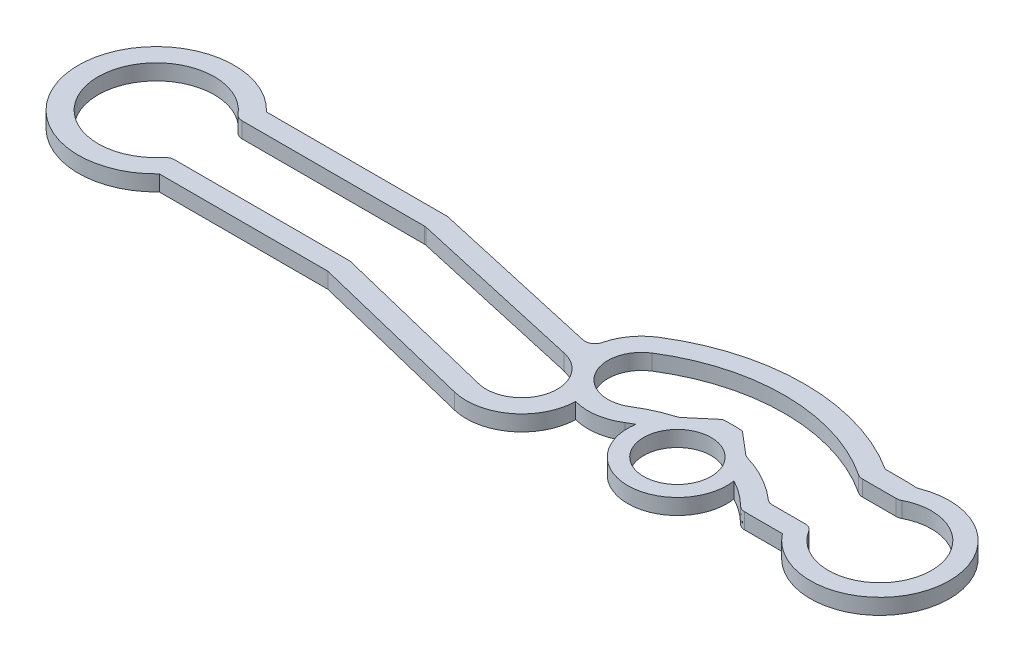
ISO-10303-21;
HEADER;
FILE_DESCRIPTION(('STEP AP214'),'2;1');
FILE_NAME('part.step','',(''),(''),'','','');
FILE_SCHEMA(('AUTOMOTIVE_DESIGN { 1 0 10303 214 1 1 1 1 }'));
ENDSEC;
DATA;
#1=APPLICATION_CONTEXT('core data for automotive mechanical design processes');
#2=APPLICATION_PROTOCOL_DEFINITION('international standard','automotive_design',2000,#1);
#3=PRODUCT_CONTEXT('',#1,'mechanical');
#4=PRODUCT('Part','Part','',(#3));
#5=PRODUCT_RELATED_PRODUCT_CATEGORY('part','',(#4));
#6=PRODUCT_DEFINITION_FORMATION('','',#4);
#7=PRODUCT_DEFINITION_CONTEXT('part definition',#1,'design');
#8=PRODUCT_DEFINITION('design','',#6,#7);
#9=PRODUCT_DEFINITION_SHAPE('','',#8);
#10=(LENGTH_UNIT() NAMED_UNIT(*) SI_UNIT(.MILLI.,.METRE.));
#11=(NAMED_UNIT(*) PLANE_ANGLE_UNIT() SI_UNIT($,.RADIAN.));
#12=(NAMED_UNIT(*) SI_UNIT($,.STERADIAN.) SOLID_ANGLE_UNIT());
#13=UNCERTAINTY_MEASURE_WITH_UNIT(LENGTH_MEASURE(1.E-05),#10,'distance_accuracy_value','');
#14=(GEOMETRIC_REPRESENTATION_CONTEXT(3) GLOBAL_UNCERTAINTY_ASSIGNED_CONTEXT((#13)) GLOBAL_UNIT_ASSIGNED_CONTEXT((#10,
#11,#12)) REPRESENTATION_CONTEXT('',''));
#15=CARTESIAN_POINT('',(0.,0.,0.));
#16=DIRECTION('',(0.,0.,1.));
#17=DIRECTION('',(1.,0.,0.));
#18=AXIS2_PLACEMENT_3D('',#15,#16,#17);
#19=CARTESIAN_POINT('',(36.9882088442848,-51.91,-0.459497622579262));
#20=DIRECTION('',(0.,-1.,0.));
#21=DIRECTION('',(0.,0.,-1.));
#22=AXIS2_PLACEMENT_3D('',#19,#20,#21);
#23=CYLINDRICAL_SURFACE('',#22,2.7);
#24=CARTESIAN_POINT('',(36.9882088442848,-52.7,-0.459497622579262));
#25=DIRECTION('',(0.,1.,0.));
#26=DIRECTION('',(0.,0.,1.));
#27=AXIS2_PLACEMENT_3D('',#24,#25,#26);
#28=CIRCLE('',#27,2.7);
#29=CARTESIAN_POINT('',(36.2699869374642,-52.7,2.14322350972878));
#30=VERTEX_POINT('',#29);
#31=CARTESIAN_POINT('',(38.4265633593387,-52.7,1.82548296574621));
#32=VERTEX_POINT('',#31);
#33=EDGE_CURVE('E973',#30,#32,#28,.T.);
#34=ORIENTED_EDGE('',*,*,#33,.T.);
#35=DIRECTION('',(0.,-1.,0.));
#36=VECTOR('',#35,1.);
#37=CARTESIAN_POINT('',(38.4265633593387,-51.91,1.82548296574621));
#38=LINE('',#37,#36);
#39=CARTESIAN_POINT('',(38.4265633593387,-51.91,1.82548296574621));
#40=VERTEX_POINT('',#39);
#41=EDGE_CURVE('E579',#40,#32,#38,.T.);
#42=ORIENTED_EDGE('',*,*,#41,.F.);
#43=CARTESIAN_POINT('',(36.9882088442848,-51.91,-0.459497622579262));
#44=DIRECTION('',(0.,1.,0.));
#45=DIRECTION('',(0.,0.,1.));
#46=AXIS2_PLACEMENT_3D('',#43,#44,#45);
#47=CIRCLE('',#46,2.7);
#48=CARTESIAN_POINT('',(36.2699869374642,-51.91,2.14322350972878));
#49=VERTEX_POINT('',#48);
#50=EDGE_CURVE('E434',#49,#40,#47,.T.);
#51=ORIENTED_EDGE('',*,*,#50,.F.);
#52=DIRECTION('',(0.,-1.,0.));
#53=VECTOR('',#52,1.);
#54=CARTESIAN_POINT('',(36.2699869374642,-51.91,2.14322350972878));
#55=LINE('',#54,#53);
#56=EDGE_CURVE('E594',#49,#30,#55,.T.);
#57=ORIENTED_EDGE('',*,*,#56,.T.);
#58=EDGE_LOOP('',(#34,#42,#51,#57));
#59=FACE_BOUND('',#58,.T.);
#60=ADVANCED_FACE('F47',(#59),#23,.T.);
#61=CARTESIAN_POINT('',(41.25,-51.91,6.3108152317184));
#62=DIRECTION('',(0.,-1.,0.));
#63=DIRECTION('',(0.,0.,-1.));
#64=AXIS2_PLACEMENT_3D('',#61,#62,#63);
#65=CYLINDRICAL_SURFACE('',#64,5.3);
#66=CARTESIAN_POINT('',(41.25,-52.7,6.3108152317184));
#67=DIRECTION('',(0.,1.,0.));
#68=DIRECTION('',(0.,0.,1.));
#69=AXIS2_PLACEMENT_3D('',#66,#67,#68);
#70=CIRCLE('',#69,5.3);
#71=CARTESIAN_POINT('',(38.7787047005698,-52.7,1.62224406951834));
#72=VERTEX_POINT('',#71);
#73=EDGE_CURVE('E975',#32,#72,#70,.F.);
#74=ORIENTED_EDGE('',*,*,#73,.T.);
#75=DIRECTION('',(0.,-1.,0.));
#76=VECTOR('',#75,1.);
#77=CARTESIAN_POINT('',(38.7787047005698,-51.91,1.62224406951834));
#78=LINE('',#77,#76);
#79=CARTESIAN_POINT('',(38.7787047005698,-51.91,1.62224406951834));
#80=VERTEX_POINT('',#79);
#81=EDGE_CURVE('E577',#80,#72,#78,.T.);
#82=ORIENTED_EDGE('',*,*,#81,.F.);
#83=CARTESIAN_POINT('',(41.25,-51.91,6.3108152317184));
#84=DIRECTION('',(0.,1.,0.));
#85=DIRECTION('',(0.,0.,1.));
#86=AXIS2_PLACEMENT_3D('',#83,#84,#85);
#87=CIRCLE('',#86,5.3);
#88=EDGE_CURVE('E437',#40,#80,#87,.F.);
#89=ORIENTED_EDGE('',*,*,#88,.F.);
#90=ORIENTED_EDGE('',*,*,#41,.T.);
#91=EDGE_LOOP('',(#74,#82,#89,#90));
#92=FACE_BOUND('',#91,.T.);
#93=ADVANCED_FACE('F685',(#92),#65,.F.);
#94=CARTESIAN_POINT('',(41.25,-51.91,2.));
#95=DIRECTION('',(0.,-1.,0.));
#96=DIRECTION('',(0.,0.,-1.));
#97=AXIS2_PLACEMENT_3D('',#94,#95,#96);
#98=CYLINDRICAL_SURFACE('',#97,2.5);
#99=CARTESIAN_POINT('',(41.25,-52.7,2.));
#100=DIRECTION('',(0.,1.,0.));
#101=DIRECTION('',(0.,0.,1.));
#102=AXIS2_PLACEMENT_3D('',#99,#100,#101);
#103=CIRCLE('',#102,2.5);
#104=CARTESIAN_POINT('',(43.7212952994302,-52.7,1.62224406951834));
#105=VERTEX_POINT('',#104);
#106=EDGE_CURVE('E978',#105,#72,#103,.F.);
#107=ORIENTED_EDGE('',*,*,#106,.F.);
#108=DIRECTION('',(0.,-1.,0.));
#109=VECTOR('',#108,1.);
#110=CARTESIAN_POINT('',(43.7212952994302,-51.91,1.62224406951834));
#111=LINE('',#110,#109);
#112=CARTESIAN_POINT('',(43.7212952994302,-51.91,1.62224406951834));
#113=VERTEX_POINT('',#112);
#114=EDGE_CURVE('E557',#113,#105,#111,.T.);
#115=ORIENTED_EDGE('',*,*,#114,.F.);
#116=CARTESIAN_POINT('',(41.25,-51.91,2.));
#117=DIRECTION('',(0.,1.,0.));
#118=DIRECTION('',(0.,0.,1.));
#119=AXIS2_PLACEMENT_3D('',#116,#117,#118);
#120=CIRCLE('',#119,2.5);
#121=EDGE_CURVE('E439',#113,#80,#120,.F.);
#122=ORIENTED_EDGE('',*,*,#121,.T.);
#123=ORIENTED_EDGE('',*,*,#81,.T.);
#124=EDGE_LOOP('',(#107,#115,#122,#123));
#125=FACE_BOUND('',#124,.T.);
#126=ADVANCED_FACE('F691',(#125),#98,.T.);
#127=CARTESIAN_POINT('',(41.25,-51.91,6.3108152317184));
#128=DIRECTION('',(0.,-1.,0.));
#129=DIRECTION('',(0.,0.,-1.));
#130=AXIS2_PLACEMENT_3D('',#127,#128,#129);
#131=CYLINDRICAL_SURFACE('',#130,5.3);
#132=CARTESIAN_POINT('',(41.25,-52.7,6.3108152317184));
#133=DIRECTION('',(0.,1.,0.));
#134=DIRECTION('',(0.,0.,1.));
#135=AXIS2_PLACEMENT_3D('',#132,#133,#134);
#136=CIRCLE('',#135,5.3);
#137=CARTESIAN_POINT('',(44.988897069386,-52.7,2.55440089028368));
#138=VERTEX_POINT('',#137);
#139=EDGE_CURVE('E490',#105,#138,#136,.F.);
#140=ORIENTED_EDGE('',*,*,#139,.T.);
#141=DIRECTION('',(0.,-1.,0.));
#142=VECTOR('',#141,1.);
#143=CARTESIAN_POINT('',(44.988897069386,-51.91,2.55440089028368));
#144=LINE('',#143,#142);
#145=CARTESIAN_POINT('',(44.988897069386,-51.91,2.55440089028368));
#146=VERTEX_POINT('',#145);
#147=EDGE_CURVE('E545',#146,#138,#144,.T.);
#148=ORIENTED_EDGE('',*,*,#147,.F.);
#149=CARTESIAN_POINT('',(41.25,-51.91,6.3108152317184));
#150=DIRECTION('',(0.,1.,0.));
#151=DIRECTION('',(0.,0.,1.));
#152=AXIS2_PLACEMENT_3D('',#149,#150,#151);
#153=CIRCLE('',#152,5.3);
#154=EDGE_CURVE('E442',#113,#146,#153,.F.);
#155=ORIENTED_EDGE('',*,*,#154,.F.);
#156=ORIENTED_EDGE('',*,*,#114,.T.);
#157=EDGE_LOOP('',(#140,#148,#155,#156));
#158=FACE_BOUND('',#157,.T.);
#159=ADVANCED_FACE('F459',(#158),#131,.F.);
#160=CARTESIAN_POINT('',(44.988897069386,-51.91,2.55440089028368));
#161=CARTESIAN_POINT('',(45.0823668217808,-51.91,2.64743476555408));
#162=CARTESIAN_POINT('',(45.209691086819,-51.91,2.7));
#163=CARTESIAN_POINT('',(45.341569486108,-51.91,2.7));
#164=B_SPLINE_CURVE_WITH_KNOTS('',3,(#160,#161,#162,#163),.UNSPECIFIED.,.F.,.F.,(4,4),(0.,1.),.UNSPECIFIED.);
#165=DIRECTION('',(0.,-1.,0.));
#166=VECTOR('',#165,1.);
#167=SURFACE_OF_LINEAR_EXTRUSION('',#164,#166);
#168=CARTESIAN_POINT('',(44.988897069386,-52.7,2.55440089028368));
#169=CARTESIAN_POINT('',(45.0823668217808,-52.7,2.64743476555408));
#170=CARTESIAN_POINT('',(45.209691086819,-52.7,2.7));
#171=CARTESIAN_POINT('',(45.341569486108,-52.7,2.7));
#172=B_SPLINE_CURVE_WITH_KNOTS('',3,(#168,#169,#170,#171),.UNSPECIFIED.,.F.,.F.,(4,4),(0.,1.),.UNSPECIFIED.);
#173=CARTESIAN_POINT('',(45.341569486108,-52.7,2.7));
#174=VERTEX_POINT('',#173);
#175=EDGE_CURVE('E485',#138,#174,#172,.T.);
#176=ORIENTED_EDGE('',*,*,#175,.T.);
#177=DIRECTION('',(0.,-1.,0.));
#178=VECTOR('',#177,1.);
#179=CARTESIAN_POINT('',(45.341569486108,-51.91,2.7));
#180=LINE('',#179,#178);
#181=CARTESIAN_POINT('',(45.341569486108,-51.91,2.7));
#182=VERTEX_POINT('',#181);
#183=EDGE_CURVE('E547',#182,#174,#180,.T.);
#184=ORIENTED_EDGE('',*,*,#183,.F.);
#185=CARTESIAN_POINT('',(45.341569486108,-51.91,2.7));
#186=CARTESIAN_POINT('',(45.209691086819,-51.91,2.7));
#187=CARTESIAN_POINT('',(45.0823668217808,-51.91,2.64743476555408));
#188=CARTESIAN_POINT('',(44.988897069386,-51.91,2.55440089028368));
#189=B_SPLINE_CURVE_WITH_KNOTS('',3,(#185,#186,#187,#188),.UNSPECIFIED.,.F.,.F.,(4,4),(0.,1.),.UNSPECIFIED.);
#190=EDGE_CURVE('E534',#146,#182,#189,.F.);
#191=ORIENTED_EDGE('',*,*,#190,.F.);
#192=ORIENTED_EDGE('',*,*,#147,.T.);
#193=EDGE_LOOP('',(#176,#184,#191,#192));
#194=FACE_BOUND('',#193,.T.);
#195=ADVANCED_FACE('F453',(#194),#167,.F.);
#196=CARTESIAN_POINT('',(0.,-51.91,2.70000000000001));
#197=DIRECTION('',(0.,0.,-1.));
#198=DIRECTION('',(-1.,0.,0.));
#199=AXIS2_PLACEMENT_3D('',#196,#197,#198);
#200=PLANE('',#199);
#201=DIRECTION('',(1.,0.,0.));
#202=VECTOR('',#201,1.);
#203=CARTESIAN_POINT('',(0.,-52.7,2.70000000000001));
#204=LINE('',#203,#202);
#205=CARTESIAN_POINT('',(47.2382071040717,-52.7,2.7));
#206=VERTEX_POINT('',#205);
#207=EDGE_CURVE('E983',#174,#206,#204,.T.);
#208=ORIENTED_EDGE('',*,*,#207,.T.);
#209=DIRECTION('',(0.,-1.,0.));
#210=VECTOR('',#209,1.);
#211=CARTESIAN_POINT('',(47.2382071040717,-51.91,2.7));
#212=LINE('',#211,#210);
#213=CARTESIAN_POINT('',(47.2382071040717,-51.91,2.7));
#214=VERTEX_POINT('',#213);
#215=EDGE_CURVE('E561',#214,#206,#212,.T.);
#216=ORIENTED_EDGE('',*,*,#215,.F.);
#217=DIRECTION('',(1.,0.,0.));
#218=VECTOR('',#217,1.);
#219=CARTESIAN_POINT('',(0.,-51.91,2.70000000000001));
#220=LINE('',#219,#218);
#221=EDGE_CURVE('E549',#182,#214,#220,.T.);
#222=ORIENTED_EDGE('',*,*,#221,.F.);
#223=ORIENTED_EDGE('',*,*,#183,.T.);
#224=EDGE_LOOP('',(#208,#216,#222,#223));
#225=FACE_BOUND('',#224,.T.);
#226=ADVANCED_FACE('F458',(#225),#200,.F.);
#227=CARTESIAN_POINT('',(50.,-51.91,0.550000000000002));
#228=DIRECTION('',(0.,-1.,0.));
#229=DIRECTION('',(0.,0.,-1.));
#230=AXIS2_PLACEMENT_3D('',#227,#228,#229);
#231=CYLINDRICAL_SURFACE('',#230,3.5);
#232=CARTESIAN_POINT('',(50.,-52.7,0.550000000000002));
#233=DIRECTION('',(0.,1.,0.));
#234=DIRECTION('',(0.,0.,1.));
#235=AXIS2_PLACEMENT_3D('',#232,#233,#234);
#236=CIRCLE('',#235,3.5);
#237=CARTESIAN_POINT('',(48.7009618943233,-52.7,-2.7));
#238=VERTEX_POINT('',#237);
#239=EDGE_CURVE('E524',#238,#206,#236,.F.);
#240=ORIENTED_EDGE('',*,*,#239,.F.);
#241=DIRECTION('',(0.,-1.,0.));
#242=VECTOR('',#241,1.);
#243=CARTESIAN_POINT('',(48.7009618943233,-51.91,-2.7));
#244=LINE('',#243,#242);
#245=CARTESIAN_POINT('',(48.7009618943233,-51.91,-2.7));
#246=VERTEX_POINT('',#245);
#247=EDGE_CURVE('E566',#246,#238,#244,.T.);
#248=ORIENTED_EDGE('',*,*,#247,.F.);
#249=CARTESIAN_POINT('',(50.,-51.91,0.550000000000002));
#250=DIRECTION('',(0.,1.,0.));
#251=DIRECTION('',(0.,0.,1.));
#252=AXIS2_PLACEMENT_3D('',#249,#250,#251);
#253=CIRCLE('',#252,3.5);
#254=EDGE_CURVE('E447',#246,#214,#253,.F.);
#255=ORIENTED_EDGE('',*,*,#254,.T.);
#256=ORIENTED_EDGE('',*,*,#215,.T.);
#257=EDGE_LOOP('',(#240,#248,#255,#256));
#258=FACE_BOUND('',#257,.T.);
#259=ADVANCED_FACE('F1040',(#258),#231,.T.);
#260=CARTESIAN_POINT('',(0.,-51.91,-2.7));
#261=DIRECTION('',(0.,0.,-1.));
#262=DIRECTION('',(-1.,0.,0.));
#263=AXIS2_PLACEMENT_3D('',#260,#261,#262);
#264=PLANE('',#263);
#265=DIRECTION('',(1.,0.,0.));
#266=VECTOR('',#265,1.);
#267=CARTESIAN_POINT('',(0.,-52.7,-2.7));
#268=LINE('',#267,#266);
#269=CARTESIAN_POINT('',(48.6964935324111,-52.7,-2.69999999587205));
#270=VERTEX_POINT('',#269);
#271=EDGE_CURVE('E515',#270,#238,#268,.T.);
#272=ORIENTED_EDGE('',*,*,#271,.F.);
#273=DIRECTION('',(0.,-1.,0.));
#274=VECTOR('',#273,1.);
#275=CARTESIAN_POINT('',(48.6964935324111,-51.91,-2.69999999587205));
#276=LINE('',#275,#274);
#277=CARTESIAN_POINT('',(48.6964935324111,-51.91,-2.69999999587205));
#278=VERTEX_POINT('',#277);
#279=EDGE_CURVE('E572',#278,#270,#276,.T.);
#280=ORIENTED_EDGE('',*,*,#279,.F.);
#281=DIRECTION('',(1.,0.,0.));
#282=VECTOR('',#281,1.);
#283=CARTESIAN_POINT('',(0.,-51.91,-2.7));
#284=LINE('',#283,#282);
#285=EDGE_CURVE('E1038',#278,#246,#284,.T.);
#286=ORIENTED_EDGE('',*,*,#285,.T.);
#287=ORIENTED_EDGE('',*,*,#247,.T.);
#288=EDGE_LOOP('',(#272,#280,#286,#287));
#289=FACE_BOUND('',#288,.T.);
#290=ADVANCED_FACE('F633',(#289),#264,.T.);
#291=CARTESIAN_POINT('',(48.7326696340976,-51.91,-2.71249501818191));
#292=CARTESIAN_POINT('',(48.662534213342,-51.91,-2.68525060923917));
#293=CARTESIAN_POINT('',(48.5878834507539,-51.91,-2.67424061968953));
#294=CARTESIAN_POINT('',(48.5128689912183,-51.91,-2.68007736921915));
#295=B_SPLINE_CURVE_WITH_KNOTS('',3,(#291,#292,#293,#294),.UNSPECIFIED.,.F.,.F.,(4,4),(0.,1.),.UNSPECIFIED.);
#296=DIRECTION('',(0.,-1.,0.));
#297=VECTOR('',#296,1.);
#298=SURFACE_OF_LINEAR_EXTRUSION('',#295,#297);
#299=CARTESIAN_POINT('',(48.6964935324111,-52.7,-2.69999999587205));
#300=CARTESIAN_POINT('',(48.6371174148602,-52.7,-2.68199135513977));
#301=CARTESIAN_POINT('',(48.5751184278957,-52.7,-2.67523384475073));
#302=CARTESIAN_POINT('',(48.5128689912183,-52.7,-2.68007736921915));
#303=B_SPLINE_CURVE_WITH_KNOTS('',3,(#299,#300,#301,#302),.UNSPECIFIED.,.F.,.F.,(4,4),
(0.170167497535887,1.),.UNSPECIFIED.);
#304=CARTESIAN_POINT('',(48.5128689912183,-52.7,-2.68007736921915));
#305=VERTEX_POINT('',#304);
#306=EDGE_CURVE('E523',#270,#305,#303,.T.);
#307=ORIENTED_EDGE('',*,*,#306,.T.);
#308=DIRECTION('',(0.,-1.,0.));
#309=VECTOR('',#308,1.);
#310=CARTESIAN_POINT('',(48.5128689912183,-51.91,-2.68007736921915));
#311=LINE('',#310,#309);
#312=CARTESIAN_POINT('',(48.5128689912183,-51.91,-2.68007736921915));
#313=VERTEX_POINT('',#312);
#314=EDGE_CURVE('E1011',#313,#305,#311,.T.);
#315=ORIENTED_EDGE('',*,*,#314,.F.);
#316=CARTESIAN_POINT('',(48.5128689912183,-51.91,-2.68007736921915));
#317=CARTESIAN_POINT('',(48.5751184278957,-51.91,-2.67523384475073));
#318=CARTESIAN_POINT('',(48.6371174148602,-51.91,-2.68199135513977));
#319=CARTESIAN_POINT('',(48.6964935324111,-51.91,-2.69999999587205));
#320=B_SPLINE_CURVE_WITH_KNOTS('',3,(#316,#317,#318,#319),.UNSPECIFIED.,.F.,.F.,(4,4),
(0.170167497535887,1.),.UNSPECIFIED.);
#321=EDGE_CURVE('E605',#278,#313,#320,.F.);
#322=ORIENTED_EDGE('',*,*,#321,.F.);
#323=ORIENTED_EDGE('',*,*,#279,.T.);
#324=EDGE_LOOP('',(#307,#315,#322,#323));
#325=FACE_BOUND('',#324,.T.);
#326=ADVANCED_FACE('F622',(#325),#298,.F.);
#327=CARTESIAN_POINT('',(48.,-51.91,3.91136363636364));
#328=DIRECTION('',(0.,-1.,0.));
#329=DIRECTION('',(0.,0.,-1.));
#330=AXIS2_PLACEMENT_3D('',#327,#328,#329);
#331=CYLINDRICAL_SURFACE('',#330,6.61136363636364);
#332=CARTESIAN_POINT('',(48.,-52.7,3.91136363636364));
#333=DIRECTION('',(0.,1.,0.));
#334=DIRECTION('',(0.,0.,1.));
#335=AXIS2_PLACEMENT_3D('',#332,#333,#334);
#336=CIRCLE('',#335,6.61136363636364);
#337=CARTESIAN_POINT('',(48.,-52.7,-2.7));
#338=VERTEX_POINT('',#337);
#339=EDGE_CURVE('E527',#305,#338,#336,.T.);
#340=ORIENTED_EDGE('',*,*,#339,.T.);
#341=DIRECTION('',(0.,-1.,0.));
#342=VECTOR('',#341,1.);
#343=CARTESIAN_POINT('',(48.,-51.91,-2.7));
#344=LINE('',#343,#342);
#345=CARTESIAN_POINT('',(48.,-51.91,-2.7));
#346=VERTEX_POINT('',#345);
#347=EDGE_CURVE('E1009',#346,#338,#344,.T.);
#348=ORIENTED_EDGE('',*,*,#347,.F.);
#349=CARTESIAN_POINT('',(48.,-51.91,3.91136363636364));
#350=DIRECTION('',(0.,1.,0.));
#351=DIRECTION('',(0.,0.,1.));
#352=AXIS2_PLACEMENT_3D('',#349,#350,#351);
#353=CIRCLE('',#352,6.61136363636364);
#354=EDGE_CURVE('E646',#313,#346,#353,.T.);
#355=ORIENTED_EDGE('',*,*,#354,.F.);
#356=ORIENTED_EDGE('',*,*,#314,.T.);
#357=EDGE_LOOP('',(#340,#348,#355,#356));
#358=FACE_BOUND('',#357,.T.);
#359=ADVANCED_FACE('F632',(#358),#331,.T.);
#360=CARTESIAN_POINT('',(0.,-51.91,-2.69999999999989));
#361=DIRECTION('',(0.,0.,1.));
#362=DIRECTION('',(1.,0.,0.));
#363=AXIS2_PLACEMENT_3D('',#360,#361,#362);
#364=PLANE('',#363);
#365=DIRECTION('',(-1.,0.,0.));
#366=VECTOR('',#365,1.);
#367=CARTESIAN_POINT('',(0.,-52.7,-2.69999999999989));
#368=LINE('',#367,#366);
#369=CARTESIAN_POINT('',(47.0202000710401,-52.7,-2.7));
#370=VERTEX_POINT('',#369);
#371=EDGE_CURVE('E529',#338,#370,#368,.T.);
#372=ORIENTED_EDGE('',*,*,#371,.T.);
#373=DIRECTION('',(0.,-1.,0.));
#374=VECTOR('',#373,1.);
#375=CARTESIAN_POINT('',(47.0202000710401,-51.91,-2.7));
#376=LINE('',#375,#374);
#377=CARTESIAN_POINT('',(47.0202000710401,-51.91,-2.7));
#378=VERTEX_POINT('',#377);
#379=EDGE_CURVE('E1008',#378,#370,#376,.T.);
#380=ORIENTED_EDGE('',*,*,#379,.F.);
#381=DIRECTION('',(-1.,0.,0.));
#382=VECTOR('',#381,1.);
#383=CARTESIAN_POINT('',(0.,-51.91,-2.69999999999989));
#384=LINE('',#383,#382);
#385=EDGE_CURVE('E640',#346,#378,#384,.T.);
#386=ORIENTED_EDGE('',*,*,#385,.F.);
#387=ORIENTED_EDGE('',*,*,#347,.T.);
#388=EDGE_LOOP('',(#372,#380,#386,#387));
#389=FACE_BOUND('',#388,.T.);
#390=ADVANCED_FACE('F675',(#389),#364,.F.);
#391=CARTESIAN_POINT('',(41.25,-51.91,6.3108152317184));
#392=DIRECTION('',(0.,-1.,0.));
#393=DIRECTION('',(0.,0.,-1.));
#394=AXIS2_PLACEMENT_3D('',#391,#392,#393);
#395=CYLINDRICAL_SURFACE('',#394,10.7);
#396=CARTESIAN_POINT('',(41.25,-52.7,6.3108152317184));
#397=DIRECTION('',(0.,1.,0.));
#398=DIRECTION('',(0.,0.,1.));
#399=AXIS2_PLACEMENT_3D('',#396,#397,#398);
#400=CIRCLE('',#399,10.7);
#401=CARTESIAN_POINT('',(35.549854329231,-52.7,-2.74447821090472));
#402=VERTEX_POINT('',#401);
#403=EDGE_CURVE('E897',#402,#370,#400,.F.);
#404=ORIENTED_EDGE('',*,*,#403,.F.);
#405=DIRECTION('',(0.,-1.,0.));
#406=VECTOR('',#405,1.);
#407=CARTESIAN_POINT('',(35.549854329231,-51.91,-2.74447821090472));
#408=LINE('',#407,#406);
#409=CARTESIAN_POINT('',(35.549854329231,-51.91,-2.74447821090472));
#410=VERTEX_POINT('',#409);
#411=EDGE_CURVE('E895',#410,#402,#408,.T.);
#412=ORIENTED_EDGE('',*,*,#411,.F.);
#413=CARTESIAN_POINT('',(41.25,-51.91,6.3108152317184));
#414=DIRECTION('',(0.,1.,0.));
#415=DIRECTION('',(0.,0.,1.));
#416=AXIS2_PLACEMENT_3D('',#413,#414,#415);
#417=CIRCLE('',#416,10.7);
#418=EDGE_CURVE('E645',#410,#378,#417,.F.);
#419=ORIENTED_EDGE('',*,*,#418,.T.);
#420=ORIENTED_EDGE('',*,*,#379,.T.);
#421=EDGE_LOOP('',(#404,#412,#419,#420));
#422=FACE_BOUND('',#421,.T.);
#423=ADVANCED_FACE('F673',(#422),#395,.T.);
#424=CARTESIAN_POINT('',(36.9882088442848,-51.91,-0.459497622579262));
#425=DIRECTION('',(0.,-1.,0.));
#426=DIRECTION('',(0.,0.,-1.));
#427=AXIS2_PLACEMENT_3D('',#424,#425,#426);
#428=CYLINDRICAL_SURFACE('',#427,2.70000000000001);
#429=CARTESIAN_POINT('',(36.9882088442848,-52.7,-0.459497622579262));
#430=DIRECTION('',(0.,1.,0.));
#431=DIRECTION('',(0.,0.,1.));
#432=AXIS2_PLACEMENT_3D('',#429,#430,#431);
#433=CIRCLE('',#432,2.70000000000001);
#434=CARTESIAN_POINT('',(34.3645603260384,-52.7,-1.09704640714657));
#435=VERTEX_POINT('',#434);
#436=EDGE_CURVE('E888',#435,#402,#433,.F.);
#437=ORIENTED_EDGE('',*,*,#436,.F.);
#438=DIRECTION('',(0.,-1.,0.));
#439=VECTOR('',#438,1.);
#440=CARTESIAN_POINT('',(34.3645603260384,-51.91,-1.09704640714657));
#441=LINE('',#440,#439);
#442=CARTESIAN_POINT('',(34.3645603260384,-51.91,-1.09704640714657));
#443=VERTEX_POINT('',#442);
#444=EDGE_CURVE('E68',#435,#443,#441,.F.);
#445=ORIENTED_EDGE('',*,*,#444,.T.);
#446=CARTESIAN_POINT('',(36.9882088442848,-51.91,-0.459497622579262));
#447=DIRECTION('',(0.,1.,0.));
#448=DIRECTION('',(0.,0.,1.));
#449=AXIS2_PLACEMENT_3D('',#446,#447,#448);
#450=CIRCLE('',#449,2.70000000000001);
#451=EDGE_CURVE('E649',#443,#410,#450,.F.);
#452=ORIENTED_EDGE('',*,*,#451,.T.);
#453=ORIENTED_EDGE('',*,*,#411,.T.);
#454=EDGE_LOOP('',(#437,#445,#452,#453));
#455=FACE_BOUND('',#454,.T.);
#456=ADVANCED_FACE('F669',(#455),#428,.T.);
#457=CARTESIAN_POINT('',(1.77070128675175,-51.91,-7.89967128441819));
#458=DIRECTION('',(0.218721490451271,0.,-0.975787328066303));
#459=DIRECTION('',(-0.975787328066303,0.,-0.218721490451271));
#460=AXIS2_PLACEMENT_3D('',#457,#458,#459);
#461=PLANE('',#460);
#462=DIRECTION('',(0.975787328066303,0.,0.218721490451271));
#463=VECTOR('',#462,1.);
#464=CARTESIAN_POINT('',(1.77070128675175,-51.91,-7.89967128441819));
#465=LINE('',#464,#463);
#466=CARTESIAN_POINT('',(25.0221191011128,-51.91,-2.68789550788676));
#467=VERTEX_POINT('',#466);
#468=CARTESIAN_POINT('',(33.7693387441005,-51.91,-0.727217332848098));
#469=VERTEX_POINT('',#468);
#470=EDGE_CURVE('E651',#467,#469,#465,.T.);
#471=ORIENTED_EDGE('',*,*,#470,.T.);
#472=DIRECTION('',(0.,1.,0.));
#473=VECTOR('',#472,1.);
#474=CARTESIAN_POINT('',(33.7693387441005,-52.7,-0.727217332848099));
#475=LINE('',#474,#473);
#476=CARTESIAN_POINT('',(33.7693387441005,-52.7,-0.727217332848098));
#477=VERTEX_POINT('',#476);
#478=EDGE_CURVE('E867',#469,#477,#475,.F.);
#479=ORIENTED_EDGE('',*,*,#478,.T.);
#480=DIRECTION('',(0.975787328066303,0.,0.218721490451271));
#481=VECTOR('',#480,1.);
#482=CARTESIAN_POINT('',(1.77070128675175,-52.7,-7.89967128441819));
#483=LINE('',#482,#481);
#484=CARTESIAN_POINT('',(25.0221191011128,-52.7,-2.68789550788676));
#485=VERTEX_POINT('',#484);
#486=EDGE_CURVE('E892',#485,#477,#483,.T.);
#487=ORIENTED_EDGE('',*,*,#486,.F.);
#488=DIRECTION('',(0.,-1.,0.));
#489=VECTOR('',#488,1.);
#490=CARTESIAN_POINT('',(25.0221191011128,-51.91,-2.68789550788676));
#491=LINE('',#490,#489);
#492=EDGE_CURVE('E899',#467,#485,#491,.T.);
#493=ORIENTED_EDGE('',*,*,#492,.F.);
#494=EDGE_LOOP('',(#471,#479,#487,#493));
#495=FACE_BOUND('',#494,.T.);
#496=ADVANCED_FACE('F664',(#495),#461,.T.);
#497=CARTESIAN_POINT('',(24.9127581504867,-51.91,-2.19992383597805));
#498=DIRECTION('',(0.,1.,0.));
#499=DIRECTION('',(-0.110028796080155,0.,0.9939283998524));
#500=AXIS2_PLACEMENT_3D('',#497,#498,#499);
#501=ELLIPSE('',#500,0.500077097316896,0.5);
#502=DIRECTION('',(0.,-1.,0.));
#503=VECTOR('',#502,1.);
#504=SURFACE_OF_LINEAR_EXTRUSION('',#501,#503);
#505=CARTESIAN_POINT('',(24.9127581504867,-52.7,-2.19992383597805));
#506=DIRECTION('',(0.,1.,0.));
#507=DIRECTION('',(-0.110028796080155,0.,0.9939283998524));
#508=AXIS2_PLACEMENT_3D('',#505,#506,#507);
#509=ELLIPSE('',#508,0.500077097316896,0.5);
#510=CARTESIAN_POINT('',(24.9127750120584,-52.7,-2.7));
#511=VERTEX_POINT('',#510);
#512=EDGE_CURVE('E907',#485,#511,#509,.T.);
#513=ORIENTED_EDGE('',*,*,#512,.T.);
#514=DIRECTION('',(0.,-1.,0.));
#515=VECTOR('',#514,1.);
#516=CARTESIAN_POINT('',(24.9127750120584,-51.91,-2.7));
#517=LINE('',#516,#515);
#518=CARTESIAN_POINT('',(24.9127750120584,-51.91,-2.7));
#519=VERTEX_POINT('',#518);
#520=EDGE_CURVE('E906',#519,#511,#517,.T.);
#521=ORIENTED_EDGE('',*,*,#520,.F.);
#522=EDGE_CURVE('E653',#467,#519,#501,.T.);
#523=ORIENTED_EDGE('',*,*,#522,.F.);
#524=ORIENTED_EDGE('',*,*,#492,.T.);
#525=EDGE_LOOP('',(#513,#521,#523,#524));
#526=FACE_BOUND('',#525,.T.);
#527=ADVANCED_FACE('F659',(#526),#504,.F.);
#528=CARTESIAN_POINT('',(0.,-51.91,-2.7));
#529=DIRECTION('',(0.,0.,1.));
#530=DIRECTION('',(1.,0.,0.));
#531=AXIS2_PLACEMENT_3D('',#528,#529,#530);
#532=PLANE('',#531);
#533=DIRECTION('',(-1.,0.,0.));
#534=VECTOR('',#533,1.);
#535=CARTESIAN_POINT('',(0.,-52.7,-2.7));
#536=LINE('',#535,#534);
#537=CARTESIAN_POINT('',(15.8515485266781,-52.7,-2.7));
#538=VERTEX_POINT('',#537);
#539=EDGE_CURVE('E988',#511,#538,#536,.T.);
#540=ORIENTED_EDGE('',*,*,#539,.T.);
#541=DIRECTION('',(0.,-1.,0.));
#542=VECTOR('',#541,1.);
#543=CARTESIAN_POINT('',(15.8515485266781,-51.91,-2.7));
#544=LINE('',#543,#542);
#545=CARTESIAN_POINT('',(15.8515485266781,-51.91,-2.7));
#546=VERTEX_POINT('',#545);
#547=EDGE_CURVE('E911',#546,#538,#544,.T.);
#548=ORIENTED_EDGE('',*,*,#547,.F.);
#549=DIRECTION('',(-1.,0.,0.));
#550=VECTOR('',#549,1.);
#551=CARTESIAN_POINT('',(0.,-51.91,-2.7));
#552=LINE('',#551,#550);
#553=EDGE_CURVE('E656',#519,#546,#552,.T.);
#554=ORIENTED_EDGE('',*,*,#553,.F.);
#555=ORIENTED_EDGE('',*,*,#520,.T.);
#556=EDGE_LOOP('',(#540,#548,#554,#555));
#557=FACE_BOUND('',#556,.T.);
#558=ADVANCED_FACE('F663',(#557),#532,.F.);
#559=CARTESIAN_POINT('',(13.,-51.91,0.));
#560=DIRECTION('',(0.,-1.,0.));
#561=DIRECTION('',(0.,0.,-1.));
#562=AXIS2_PLACEMENT_3D('',#559,#560,#561);
#563=CYLINDRICAL_SURFACE('',#562,3.927);
#564=CARTESIAN_POINT('',(13.,-52.7,0.));
#565=DIRECTION('',(0.,1.,0.));
#566=DIRECTION('',(0.,0.,1.));
#567=AXIS2_PLACEMENT_3D('',#564,#565,#566);
#568=CIRCLE('',#567,3.927);
#569=CARTESIAN_POINT('',(15.8515485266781,-52.7,2.7));
#570=VERTEX_POINT('',#569);
#571=EDGE_CURVE('E990',#570,#538,#568,.F.);
#572=ORIENTED_EDGE('',*,*,#571,.F.);
#573=DIRECTION('',(0.,-1.,0.));
#574=VECTOR('',#573,1.);
#575=CARTESIAN_POINT('',(15.8515485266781,-51.91,2.7));
#576=LINE('',#575,#574);
#577=CARTESIAN_POINT('',(15.8515485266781,-51.91,2.7));
#578=VERTEX_POINT('',#577);
#579=EDGE_CURVE('E1003',#578,#570,#576,.T.);
#580=ORIENTED_EDGE('',*,*,#579,.F.);
#581=CARTESIAN_POINT('',(13.,-51.91,0.));
#582=DIRECTION('',(0.,1.,0.));
#583=DIRECTION('',(0.,0.,1.));
#584=AXIS2_PLACEMENT_3D('',#581,#582,#583);
#585=CIRCLE('',#584,3.927);
#586=EDGE_CURVE('E914',#578,#546,#585,.F.);
#587=ORIENTED_EDGE('',*,*,#586,.T.);
#588=ORIENTED_EDGE('',*,*,#547,.T.);
#589=EDGE_LOOP('',(#572,#580,#587,#588));
#590=FACE_BOUND('',#589,.T.);
#591=ADVANCED_FACE('F1323',(#590),#563,.T.);
#592=CARTESIAN_POINT('',(0.,-51.91,2.7));
#593=DIRECTION('',(0.,0.,1.));
#594=DIRECTION('',(1.,0.,0.));
#595=AXIS2_PLACEMENT_3D('',#592,#593,#594);
#596=PLANE('',#595);
#597=DIRECTION('',(-1.,0.,0.));
#598=VECTOR('',#597,1.);
#599=CARTESIAN_POINT('',(0.,-52.7,2.7));
#600=LINE('',#599,#598);
#601=CARTESIAN_POINT('',(24.3425603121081,-52.7,2.7));
#602=VERTEX_POINT('',#601);
#603=EDGE_CURVE('E993',#602,#570,#600,.T.);
#604=ORIENTED_EDGE('',*,*,#603,.F.);
#605=DIRECTION('',(0.,-1.,0.));
#606=VECTOR('',#605,1.);
#607=CARTESIAN_POINT('',(24.3425603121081,-51.91,2.7));
#608=LINE('',#607,#606);
#609=CARTESIAN_POINT('',(24.3425603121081,-51.91,2.7));
#610=VERTEX_POINT('',#609);
#611=EDGE_CURVE('E1001',#610,#602,#608,.T.);
#612=ORIENTED_EDGE('',*,*,#611,.F.);
#613=DIRECTION('',(-1.,0.,0.));
#614=VECTOR('',#613,1.);
#615=CARTESIAN_POINT('',(0.,-51.91,2.7));
#616=LINE('',#615,#614);
#617=EDGE_CURVE('E915',#610,#578,#616,.T.);
#618=ORIENTED_EDGE('',*,*,#617,.T.);
#619=ORIENTED_EDGE('',*,*,#579,.T.);
#620=EDGE_LOOP('',(#604,#612,#618,#619));
#621=FACE_BOUND('',#620,.T.);
#622=ADVANCED_FACE('F1312',(#621),#596,.T.);
#623=CARTESIAN_POINT('',(0.759349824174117,-51.91,-3.09189224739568));
#624=DIRECTION('',(-0.238506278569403,0.,0.971140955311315));
#625=DIRECTION('',(0.971140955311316,0.,0.238506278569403));
#626=AXIS2_PLACEMENT_3D('',#623,#624,#625);
#627=PLANE('',#626);
#628=DIRECTION('',(-0.971140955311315,0.,-0.238506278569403));
#629=VECTOR('',#628,1.);
#630=CARTESIAN_POINT('',(0.759349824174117,-52.7,-3.09189224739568));
#631=LINE('',#630,#629);
#632=CARTESIAN_POINT('',(32.8131245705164,-52.7,4.78031877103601));
#633=VERTEX_POINT('',#632);
#634=EDGE_CURVE('E390',#633,#602,#631,.T.);
#635=ORIENTED_EDGE('',*,*,#634,.F.);
#636=DIRECTION('',(0.,-1.,0.));
#637=VECTOR('',#636,1.);
#638=CARTESIAN_POINT('',(32.8131245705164,-51.91,4.78031877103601));
#639=LINE('',#638,#637);
#640=CARTESIAN_POINT('',(32.8131245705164,-51.91,4.78031877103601));
#641=VERTEX_POINT('',#640);
#642=EDGE_CURVE('E999',#641,#633,#639,.T.);
#643=ORIENTED_EDGE('',*,*,#642,.F.);
#644=DIRECTION('',(-0.971140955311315,0.,-0.238506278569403));
#645=VECTOR('',#644,1.);
#646=CARTESIAN_POINT('',(0.759349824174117,-51.91,-3.09189224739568));
#647=LINE('',#646,#645);
#648=EDGE_CURVE('E918',#641,#610,#647,.T.);
#649=ORIENTED_EDGE('',*,*,#648,.T.);
#650=ORIENTED_EDGE('',*,*,#611,.T.);
#651=EDGE_LOOP('',(#635,#643,#649,#650));
#652=FACE_BOUND('',#651,.T.);
#653=ADVANCED_FACE('F730',(#652),#627,.T.);
#654=CARTESIAN_POINT('',(0.,-51.91,1.7));
#655=DIRECTION('',(0.,0.,1.));
#656=DIRECTION('',(1.,0.,0.));
#657=AXIS2_PLACEMENT_3D('',#654,#655,#656);
#658=PLANE('',#657);
#659=DIRECTION('',(-1.,0.,0.));
#660=VECTOR('',#659,1.);
#661=CARTESIAN_POINT('',(0.,-52.7,1.7));
#662=LINE('',#661,#660);
#663=CARTESIAN_POINT('',(24.403059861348,-52.7,1.7));
#664=VERTEX_POINT('',#663);
#665=CARTESIAN_POINT('',(15.6276089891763,-52.7,1.7));
#666=VERTEX_POINT('',#665);
#667=EDGE_CURVE('E951',#664,#666,#662,.T.);
#668=ORIENTED_EDGE('',*,*,#667,.T.);
#669=DIRECTION('',(0.,-1.,0.));
#670=VECTOR('',#669,1.);
#671=CARTESIAN_POINT('',(15.6276089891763,-51.91,1.7));
#672=LINE('',#671,#670);
#673=CARTESIAN_POINT('',(15.6276089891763,-51.91,1.7));
#674=VERTEX_POINT('',#673);
#675=EDGE_CURVE('E816',#666,#674,#672,.F.);
#676=ORIENTED_EDGE('',*,*,#675,.T.);
#677=DIRECTION('',(-1.,0.,0.));
#678=VECTOR('',#677,1.);
#679=CARTESIAN_POINT('',(0.,-51.91,1.7));
#680=LINE('',#679,#678);
#681=CARTESIAN_POINT('',(24.403059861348,-51.91,1.7));
#682=VERTEX_POINT('',#681);
#683=EDGE_CURVE('E412',#682,#674,#680,.T.);
#684=ORIENTED_EDGE('',*,*,#683,.F.);
#685=DIRECTION('',(0.,-1.,0.));
#686=VECTOR('',#685,1.);
#687=CARTESIAN_POINT('',(24.403059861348,-51.91,1.7));
#688=LINE('',#687,#686);
#689=EDGE_CURVE('E820',#682,#664,#688,.T.);
#690=ORIENTED_EDGE('',*,*,#689,.T.);
#691=EDGE_LOOP('',(#668,#676,#684,#690));
#692=FACE_BOUND('',#691,.T.);
#693=ADVANCED_FACE('F726',(#692),#658,.F.);
#694=CARTESIAN_POINT('',(13.,-51.91,0.));
#695=DIRECTION('',(0.,-1.,0.));
#696=DIRECTION('',(0.,0.,-1.));
#697=AXIS2_PLACEMENT_3D('',#694,#695,#696);
#698=CYLINDRICAL_SURFACE('',#697,2.927);
#699=CARTESIAN_POINT('',(13.,-51.91,0.));
#700=DIRECTION('',(0.,1.,0.));
#701=DIRECTION('',(0.,0.,1.));
#702=AXIS2_PLACEMENT_3D('',#699,#700,#701);
#703=CIRCLE('',#702,2.927);
#704=CARTESIAN_POINT('',(15.2442403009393,-51.91,1.87901955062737));
#705=VERTEX_POINT('',#704);
#706=CARTESIAN_POINT('',(15.2442403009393,-51.91,-1.87901955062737));
#707=VERTEX_POINT('',#706);
#708=EDGE_CURVE('E415',#705,#707,#703,.F.);
#709=ORIENTED_EDGE('',*,*,#708,.F.);
#710=DIRECTION('',(0.,-1.,0.));
#711=VECTOR('',#710,1.);
#712=CARTESIAN_POINT('',(15.2442403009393,-51.91,1.87901955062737));
#713=LINE('',#712,#711);
#714=CARTESIAN_POINT('',(15.2442403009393,-52.7,1.87901955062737));
#715=VERTEX_POINT('',#714);
#716=EDGE_CURVE('E1047',#705,#715,#713,.T.);
#717=ORIENTED_EDGE('',*,*,#716,.T.);
#718=CARTESIAN_POINT('',(13.,-52.7,0.));
#719=DIRECTION('',(0.,1.,0.));
#720=DIRECTION('',(0.,0.,1.));
#721=AXIS2_PLACEMENT_3D('',#718,#719,#720);
#722=CIRCLE('',#721,2.927);
#723=CARTESIAN_POINT('',(15.2442403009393,-52.7,-1.87901955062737));
#724=VERTEX_POINT('',#723);
#725=EDGE_CURVE('E954',#715,#724,#722,.F.);
#726=ORIENTED_EDGE('',*,*,#725,.T.);
#727=DIRECTION('',(0.,-1.,0.));
#728=VECTOR('',#727,1.);
#729=CARTESIAN_POINT('',(15.2442403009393,-51.91,-1.87901955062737));
#730=LINE('',#729,#728);
#731=EDGE_CURVE('E582',#724,#707,#730,.F.);
#732=ORIENTED_EDGE('',*,*,#731,.T.);
#733=EDGE_LOOP('',(#709,#717,#726,#732));
#734=FACE_BOUND('',#733,.T.);
#735=ADVANCED_FACE('F722',(#734),#698,.F.);
#736=CARTESIAN_POINT('',(0.,-51.91,-1.7));
#737=DIRECTION('',(0.,0.,-1.));
#738=DIRECTION('',(-1.,0.,0.));
#739=AXIS2_PLACEMENT_3D('',#736,#737,#738);
#740=PLANE('',#739);
#741=DIRECTION('',(1.,0.,0.));
#742=VECTOR('',#741,1.);
#743=CARTESIAN_POINT('',(0.,-51.91,-1.7));
#744=LINE('',#743,#742);
#745=CARTESIAN_POINT('',(15.6276089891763,-51.91,-1.7));
#746=VERTEX_POINT('',#745);
#747=CARTESIAN_POINT('',(24.8020656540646,-51.91,-1.7));
#748=VERTEX_POINT('',#747);
#749=EDGE_CURVE('E418',#746,#748,#744,.T.);
#750=ORIENTED_EDGE('',*,*,#749,.F.);
#751=DIRECTION('',(0.,-1.,0.));
#752=VECTOR('',#751,1.);
#753=CARTESIAN_POINT('',(15.6276089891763,-51.91,-1.7));
#754=LINE('',#753,#752);
#755=CARTESIAN_POINT('',(15.6276089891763,-52.7,-1.7));
#756=VERTEX_POINT('',#755);
#757=EDGE_CURVE('E833',#746,#756,#754,.T.);
#758=ORIENTED_EDGE('',*,*,#757,.T.);
#759=DIRECTION('',(1.,0.,0.));
#760=VECTOR('',#759,1.);
#761=CARTESIAN_POINT('',(0.,-52.7,-1.7));
#762=LINE('',#761,#760);
#763=CARTESIAN_POINT('',(24.8020656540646,-52.7,-1.7));
#764=VERTEX_POINT('',#763);
#765=EDGE_CURVE('E957',#756,#764,#762,.T.);
#766=ORIENTED_EDGE('',*,*,#765,.T.);
#767=DIRECTION('',(0.,-1.,0.));
#768=VECTOR('',#767,1.);
#769=CARTESIAN_POINT('',(24.8020656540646,-51.91,-1.7));
#770=LINE('',#769,#768);
#771=EDGE_CURVE('E831',#764,#748,#770,.F.);
#772=ORIENTED_EDGE('',*,*,#771,.T.);
#773=EDGE_LOOP('',(#750,#758,#766,#772));
#774=FACE_BOUND('',#773,.T.);
#775=ADVANCED_FACE('F718',(#774),#740,.F.);
#776=CARTESIAN_POINT('',(1.55197979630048,-51.91,-6.92388395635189));
#777=DIRECTION('',(0.218721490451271,0.,-0.975787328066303));
#778=DIRECTION('',(-0.975787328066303,0.,-0.218721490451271));
#779=AXIS2_PLACEMENT_3D('',#776,#777,#778);
#780=PLANE('',#779);
#781=DIRECTION('',(0.975787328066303,0.,0.218721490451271));
#782=VECTOR('',#781,1.);
#783=CARTESIAN_POINT('',(1.55197979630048,-51.91,-6.92388395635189));
#784=LINE('',#783,#782);
#785=CARTESIAN_POINT('',(24.9114263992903,-51.91,-1.68789366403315));
#786=VERTEX_POINT('',#785);
#787=CARTESIAN_POINT('',(33.870961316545,-51.91,0.320374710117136));
#788=VERTEX_POINT('',#787);
#789=EDGE_CURVE('E421',#786,#788,#784,.T.);
#790=ORIENTED_EDGE('',*,*,#789,.F.);
#791=DIRECTION('',(0.,-1.,0.));
#792=VECTOR('',#791,1.);
#793=CARTESIAN_POINT('',(24.9114263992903,-52.7,-1.68789366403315));
#794=LINE('',#793,#792);
#795=CARTESIAN_POINT('',(24.9114263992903,-52.7,-1.68789366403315));
#796=VERTEX_POINT('',#795);
#797=EDGE_CURVE('E863',#786,#796,#794,.T.);
#798=ORIENTED_EDGE('',*,*,#797,.T.);
#799=DIRECTION('',(0.975787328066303,0.,0.218721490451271));
#800=VECTOR('',#799,1.);
#801=CARTESIAN_POINT('',(1.55197979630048,-52.7,-6.92388395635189));
#802=LINE('',#801,#800);
#803=CARTESIAN_POINT('',(33.870961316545,-52.7,0.320374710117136));
#804=VERTEX_POINT('',#803);
#805=EDGE_CURVE('E960',#796,#804,#802,.T.);
#806=ORIENTED_EDGE('',*,*,#805,.T.);
#807=DIRECTION('',(0.,-1.,0.));
#808=VECTOR('',#807,1.);
#809=CARTESIAN_POINT('',(33.870961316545,-51.91,0.320374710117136));
#810=LINE('',#809,#808);
#811=EDGE_CURVE('E591',#788,#804,#810,.T.);
#812=ORIENTED_EDGE('',*,*,#811,.F.);
#813=EDGE_LOOP('',(#790,#798,#806,#812));
#814=FACE_BOUND('',#813,.T.);
#815=ADVANCED_FACE('F715',(#814),#780,.F.);
#816=CARTESIAN_POINT('',(33.4790227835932,-51.91,2.06893930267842));
#817=DIRECTION('',(0.,-1.,0.));
#818=DIRECTION('',(0.,0.,-1.));
#819=AXIS2_PLACEMENT_3D('',#816,#817,#818);
#820=CYLINDRICAL_SURFACE('',#819,1.79195255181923);
#821=CARTESIAN_POINT('',(33.4790227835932,-52.7,2.06893930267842));
#822=DIRECTION('',(0.,1.,0.));
#823=DIRECTION('',(0.,0.,1.));
#824=AXIS2_PLACEMENT_3D('',#821,#822,#823);
#825=CIRCLE('',#824,1.79195255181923);
#826=CARTESIAN_POINT('',(35.2332536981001,-52.7,2.4346821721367));
#827=VERTEX_POINT('',#826);
#828=EDGE_CURVE('E962',#804,#827,#825,.F.);
#829=ORIENTED_EDGE('',*,*,#828,.T.);
#830=DIRECTION('',(0.,-1.,0.));
#831=VECTOR('',#830,1.);
#832=CARTESIAN_POINT('',(35.2332536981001,-51.91,2.4346821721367));
#833=LINE('',#832,#831);
#834=CARTESIAN_POINT('',(35.2332536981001,-51.91,2.4346821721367));
#835=VERTEX_POINT('',#834);
#836=EDGE_CURVE('E588',#835,#827,#833,.T.);
#837=ORIENTED_EDGE('',*,*,#836,.F.);
#838=CARTESIAN_POINT('',(33.4790227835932,-51.91,2.06893930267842));
#839=DIRECTION('',(0.,1.,0.));
#840=DIRECTION('',(0.,0.,1.));
#841=AXIS2_PLACEMENT_3D('',#838,#839,#840);
#842=CIRCLE('',#841,1.79195255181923);
#843=EDGE_CURVE('E423',#788,#835,#842,.F.);
#844=ORIENTED_EDGE('',*,*,#843,.F.);
#845=ORIENTED_EDGE('',*,*,#811,.T.);
#846=EDGE_LOOP('',(#829,#837,#844,#845));
#847=FACE_BOUND('',#846,.T.);
#848=ADVANCED_FACE('F711',(#847),#820,.F.);
#849=CARTESIAN_POINT('',(34.25,-51.91,2.25));
#850=DIRECTION('',(0.,-1.,0.));
#851=DIRECTION('',(0.,0.,-1.));
#852=AXIS2_PLACEMENT_3D('',#849,#850,#851);
#853=CYLINDRICAL_SURFACE('',#852,1.00044756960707);
#854=CARTESIAN_POINT('',(34.25,-52.7,2.25));
#855=DIRECTION('',(0.,1.,0.));
#856=DIRECTION('',(0.,0.,1.));
#857=AXIS2_PLACEMENT_3D('',#854,#855,#856);
#858=CIRCLE('',#857,1.00044756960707);
#859=CARTESIAN_POINT('',(35.2126745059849,-52.7,2.52231073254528));
#860=VERTEX_POINT('',#859);
#861=EDGE_CURVE('E964',#827,#860,#858,.F.);
#862=ORIENTED_EDGE('',*,*,#861,.T.);
#863=DIRECTION('',(0.,-1.,0.));
#864=VECTOR('',#863,1.);
#865=CARTESIAN_POINT('',(35.2126745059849,-51.91,2.52231073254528));
#866=LINE('',#865,#864);
#867=CARTESIAN_POINT('',(35.2126745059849,-51.91,2.52231073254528));
#868=VERTEX_POINT('',#867);
#869=EDGE_CURVE('E585',#868,#860,#866,.T.);
#870=ORIENTED_EDGE('',*,*,#869,.F.);
#871=CARTESIAN_POINT('',(34.25,-51.91,2.25));
#872=DIRECTION('',(0.,1.,0.));
#873=DIRECTION('',(0.,0.,1.));
#874=AXIS2_PLACEMENT_3D('',#871,#872,#873);
#875=CIRCLE('',#874,1.00044756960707);
#876=EDGE_CURVE('E425',#835,#868,#875,.F.);
#877=ORIENTED_EDGE('',*,*,#876,.F.);
#878=ORIENTED_EDGE('',*,*,#836,.T.);
#879=EDGE_LOOP('',(#862,#870,#877,#878));
#880=FACE_BOUND('',#879,.T.);
#881=ADVANCED_FACE('F709',(#880),#853,.F.);
#882=CARTESIAN_POINT('',(33.0516308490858,-52.7,3.80917781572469));
#883=VERTEX_POINT('',#882);
#884=EDGE_CURVE('E965',#860,#883,#825,.F.);
#885=ORIENTED_EDGE('',*,*,#884,.T.);
#886=DIRECTION('',(0.,-1.,0.));
#887=VECTOR('',#886,1.);
#888=CARTESIAN_POINT('',(33.0516308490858,-51.91,3.80917781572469));
#889=LINE('',#888,#887);
#890=CARTESIAN_POINT('',(33.0516308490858,-51.91,3.80917781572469));
#891=VERTEX_POINT('',#890);
#892=EDGE_CURVE('E369',#891,#883,#889,.T.);
#893=ORIENTED_EDGE('',*,*,#892,.F.);
#894=EDGE_CURVE('E426',#868,#891,#842,.F.);
#895=ORIENTED_EDGE('',*,*,#894,.F.);
#896=ORIENTED_EDGE('',*,*,#869,.T.);
#897=EDGE_LOOP('',(#885,#893,#895,#896));
#898=FACE_BOUND('',#897,.T.);
#899=ADVANCED_FACE('F706',(#898),#820,.F.);
#900=CARTESIAN_POINT('',(41.25,-51.91,6.3108152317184));
#901=DIRECTION('',(0.,-1.,0.));
#902=DIRECTION('',(0.,0.,-1.));
#903=AXIS2_PLACEMENT_3D('',#900,#901,#902);
#904=CYLINDRICAL_SURFACE('',#903,6.3);
#905=CARTESIAN_POINT('',(41.25,-51.91,6.3108152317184));
#906=DIRECTION('',(0.,1.,0.));
#907=DIRECTION('',(0.,0.,1.));
#908=AXIS2_PLACEMENT_3D('',#905,#906,#907);
#909=CIRCLE('',#908,6.3);
#910=CARTESIAN_POINT('',(37.8938394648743,-51.91,0.97919385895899));
#911=VERTEX_POINT('',#910);
#912=CARTESIAN_POINT('',(39.4512035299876,-51.91,0.273072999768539));
#913=VERTEX_POINT('',#912);
#914=EDGE_CURVE('E363',#911,#913,#909,.F.);
#915=ORIENTED_EDGE('',*,*,#914,.T.);
#916=DIRECTION('',(0.,-1.,0.));
#917=VECTOR('',#916,1.);
#918=CARTESIAN_POINT('',(39.4512035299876,-51.91,0.273072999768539));
#919=LINE('',#918,#917);
#920=CARTESIAN_POINT('',(39.4512035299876,-52.7,0.273072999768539));
#921=VERTEX_POINT('',#920);
#922=EDGE_CURVE('E854',#913,#921,#919,.T.);
#923=ORIENTED_EDGE('',*,*,#922,.T.);
#924=CARTESIAN_POINT('',(41.25,-52.7,6.3108152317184));
#925=DIRECTION('',(0.,1.,0.));
#926=DIRECTION('',(0.,0.,1.));
#927=AXIS2_PLACEMENT_3D('',#924,#925,#926);
#928=CIRCLE('',#927,6.3);
#929=CARTESIAN_POINT('',(37.8938394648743,-52.7,0.97919385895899));
#930=VERTEX_POINT('',#929);
#931=EDGE_CURVE('E366',#930,#921,#928,.F.);
#932=ORIENTED_EDGE('',*,*,#931,.F.);
#933=DIRECTION('',(0.,-1.,0.));
#934=VECTOR('',#933,1.);
#935=CARTESIAN_POINT('',(37.8938394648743,-51.91,0.97919385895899));
#936=LINE('',#935,#934);
#937=EDGE_CURVE('E358',#911,#930,#936,.T.);
#938=ORIENTED_EDGE('',*,*,#937,.F.);
#939=EDGE_LOOP('',(#915,#923,#932,#938));
#940=FACE_BOUND('',#939,.T.);
#941=ADVANCED_FACE('F360',(#940),#904,.T.);
#942=CARTESIAN_POINT('',(36.9882088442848,-51.91,-0.459497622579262));
#943=DIRECTION('',(0.,-1.,0.));
#944=DIRECTION('',(0.,0.,-1.));
#945=AXIS2_PLACEMENT_3D('',#942,#943,#944);
#946=CYLINDRICAL_SURFACE('',#945,1.7);
#947=CARTESIAN_POINT('',(36.9882088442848,-52.7,-0.459497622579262));
#948=DIRECTION('',(0.,1.,0.));
#949=DIRECTION('',(0.,0.,1.));
#950=AXIS2_PLACEMENT_3D('',#947,#948,#949);
#951=CIRCLE('',#950,1.7);
#952=CARTESIAN_POINT('',(36.0825782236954,-52.7,-1.89818910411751));
#953=VERTEX_POINT('',#952);
#954=EDGE_CURVE('E926',#930,#953,#951,.F.);
#955=ORIENTED_EDGE('',*,*,#954,.T.);
#956=DIRECTION('',(0.,-1.,0.));
#957=VECTOR('',#956,1.);
#958=CARTESIAN_POINT('',(36.0825782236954,-51.91,-1.89818910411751));
#959=LINE('',#958,#957);
#960=CARTESIAN_POINT('',(36.0825782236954,-51.91,-1.89818910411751));
#961=VERTEX_POINT('',#960);
#962=EDGE_CURVE('E370',#961,#953,#959,.T.);
#963=ORIENTED_EDGE('',*,*,#962,.F.);
#964=CARTESIAN_POINT('',(36.9882088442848,-51.91,-0.459497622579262));
#965=DIRECTION('',(0.,1.,0.));
#966=DIRECTION('',(0.,0.,1.));
#967=AXIS2_PLACEMENT_3D('',#964,#965,#966);
#968=CIRCLE('',#967,1.7);
#969=EDGE_CURVE('E373',#911,#961,#968,.F.);
#970=ORIENTED_EDGE('',*,*,#969,.F.);
#971=ORIENTED_EDGE('',*,*,#937,.T.);
#972=EDGE_LOOP('',(#955,#963,#970,#971));
#973=FACE_BOUND('',#972,.T.);
#974=ADVANCED_FACE('F374',(#973),#946,.F.);
#975=CARTESIAN_POINT('',(41.25,-51.91,6.3108152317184));
#976=DIRECTION('',(0.,-1.,0.));
#977=DIRECTION('',(0.,0.,-1.));
#978=AXIS2_PLACEMENT_3D('',#975,#976,#977);
#979=CYLINDRICAL_SURFACE('',#978,9.7);
#980=CARTESIAN_POINT('',(41.25,-52.7,6.3108152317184));
#981=DIRECTION('',(0.,1.,0.));
#982=DIRECTION('',(0.,0.,1.));
#983=AXIS2_PLACEMENT_3D('',#980,#981,#982);
#984=CIRCLE('',#983,9.7);
#985=CARTESIAN_POINT('',(46.5963390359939,-52.7,-1.78280317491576));
#986=VERTEX_POINT('',#985);
#987=EDGE_CURVE('E928',#953,#986,#984,.F.);
#988=ORIENTED_EDGE('',*,*,#987,.T.);
#989=DIRECTION('',(0.,-1.,0.));
#990=VECTOR('',#989,1.);
#991=CARTESIAN_POINT('',(46.5963390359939,-51.91,-1.78280317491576));
#992=LINE('',#991,#990);
#993=CARTESIAN_POINT('',(46.5963390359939,-51.91,-1.78280317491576));
#994=VERTEX_POINT('',#993);
#995=EDGE_CURVE('E811',#986,#994,#992,.F.);
#996=ORIENTED_EDGE('',*,*,#995,.T.);
#997=CARTESIAN_POINT('',(41.25,-51.91,6.3108152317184));
#998=DIRECTION('',(0.,1.,0.));
#999=DIRECTION('',(0.,0.,1.));
#1000=AXIS2_PLACEMENT_3D('',#997,#998,#999);
#1001=CIRCLE('',#1000,9.7);
#1002=EDGE_CURVE('E379',#961,#994,#1001,.F.);
#1003=ORIENTED_EDGE('',*,*,#1002,.F.);
#1004=ORIENTED_EDGE('',*,*,#962,.T.);
#1005=EDGE_LOOP('',(#988,#996,#1003,#1004));
#1006=FACE_BOUND('',#1005,.T.);
#1007=ADVANCED_FACE('F757',(#1006),#979,.F.);
#1008=CARTESIAN_POINT('',(0.,-51.91,-1.69999999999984));
#1009=DIRECTION('',(0.,0.,-1.));
#1010=DIRECTION('',(-1.,0.,0.));
#1011=AXIS2_PLACEMENT_3D('',#1008,#1009,#1010);
#1012=PLANE('',#1011);
#1013=DIRECTION('',(1.,0.,0.));
#1014=VECTOR('',#1013,1.);
#1015=CARTESIAN_POINT('',(0.,-52.7,-1.69999999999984));
#1016=LINE('',#1015,#1014);
#1017=CARTESIAN_POINT('',(46.8719235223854,-52.7,-1.7));
#1018=VERTEX_POINT('',#1017);
#1019=CARTESIAN_POINT('',(48.5690911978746,-52.7,-1.70000000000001));
#1020=VERTEX_POINT('',#1019);
#1021=EDGE_CURVE('E931',#1018,#1020,#1016,.T.);
#1022=ORIENTED_EDGE('',*,*,#1021,.T.);
#1023=DIRECTION('',(0.,-1.,0.));
#1024=VECTOR('',#1023,1.);
#1025=CARTESIAN_POINT('',(48.5690911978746,-51.91,-1.70000000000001));
#1026=LINE('',#1025,#1024);
#1027=CARTESIAN_POINT('',(48.5690911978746,-51.91,-1.70000000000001));
#1028=VERTEX_POINT('',#1027);
#1029=EDGE_CURVE('E852',#1020,#1028,#1026,.F.);
#1030=ORIENTED_EDGE('',*,*,#1029,.T.);
#1031=DIRECTION('',(1.,0.,0.));
#1032=VECTOR('',#1031,1.);
#1033=CARTESIAN_POINT('',(0.,-51.91,-1.69999999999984));
#1034=LINE('',#1033,#1032);
#1035=CARTESIAN_POINT('',(46.8719235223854,-51.91,-1.7));
#1036=VERTEX_POINT('',#1035);
#1037=EDGE_CURVE('E394',#1036,#1028,#1034,.T.);
#1038=ORIENTED_EDGE('',*,*,#1037,.F.);
#1039=DIRECTION('',(0.,-1.,0.));
#1040=VECTOR('',#1039,1.);
#1041=CARTESIAN_POINT('',(46.8719235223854,-51.91,-1.7));
#1042=LINE('',#1041,#1040);
#1043=EDGE_CURVE('E813',#1036,#1018,#1042,.T.);
#1044=ORIENTED_EDGE('',*,*,#1043,.T.);
#1045=EDGE_LOOP('',(#1022,#1030,#1038,#1044));
#1046=FACE_BOUND('',#1045,.T.);
#1047=ADVANCED_FACE('F753',(#1046),#1012,.F.);
#1048=CARTESIAN_POINT('',(50.,-51.91,0.550000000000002));
#1049=DIRECTION('',(0.,-1.,0.));
#1050=DIRECTION('',(0.,0.,-1.));
#1051=AXIS2_PLACEMENT_3D('',#1048,#1049,#1050);
#1052=CYLINDRICAL_SURFACE('',#1051,2.6);
#1053=CARTESIAN_POINT('',(50.,-52.7,0.550000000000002));
#1054=DIRECTION('',(0.,1.,0.));
#1055=DIRECTION('',(0.,0.,1.));
#1056=AXIS2_PLACEMENT_3D('',#1053,#1054,#1055);
#1057=CIRCLE('',#1056,2.6);
#1058=CARTESIAN_POINT('',(48.7998829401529,-52.7,-1.75645161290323));
#1059=VERTEX_POINT('',#1058);
#1060=CARTESIAN_POINT('',(47.7988863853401,-52.7,1.93387096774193));
#1061=VERTEX_POINT('',#1060);
#1062=EDGE_CURVE('E934',#1059,#1061,#1057,.F.);
#1063=ORIENTED_EDGE('',*,*,#1062,.T.);
#1064=DIRECTION('',(0.,-1.,0.));
#1065=VECTOR('',#1064,1.);
#1066=CARTESIAN_POINT('',(47.7988863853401,-51.91,1.93387096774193));
#1067=LINE('',#1066,#1065);
#1068=CARTESIAN_POINT('',(47.7988863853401,-51.91,1.93387096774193));
#1069=VERTEX_POINT('',#1068);
#1070=EDGE_CURVE('E849',#1061,#1069,#1067,.F.);
#1071=ORIENTED_EDGE('',*,*,#1070,.T.);
#1072=CARTESIAN_POINT('',(50.,-51.91,0.550000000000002));
#1073=DIRECTION('',(0.,1.,0.));
#1074=DIRECTION('',(0.,0.,1.));
#1075=AXIS2_PLACEMENT_3D('',#1072,#1073,#1074);
#1076=CIRCLE('',#1075,2.6);
#1077=CARTESIAN_POINT('',(48.7998829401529,-51.91,-1.75645161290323));
#1078=VERTEX_POINT('',#1077);
#1079=EDGE_CURVE('E397',#1078,#1069,#1076,.F.);
#1080=ORIENTED_EDGE('',*,*,#1079,.F.);
#1081=DIRECTION('',(0.,-1.,0.));
#1082=VECTOR('',#1081,1.);
#1083=CARTESIAN_POINT('',(48.7998829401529,-51.91,-1.75645161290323));
#1084=LINE('',#1083,#1082);
#1085=EDGE_CURVE('E846',#1078,#1059,#1084,.T.);
#1086=ORIENTED_EDGE('',*,*,#1085,.T.);
#1087=EDGE_LOOP('',(#1063,#1071,#1080,#1086));
#1088=FACE_BOUND('',#1087,.T.);
#1089=ADVANCED_FACE('F749',(#1088),#1052,.F.);
#1090=CARTESIAN_POINT('',(0.,-51.91,1.7));
#1091=DIRECTION('',(0.,0.,1.));
#1092=DIRECTION('',(1.,0.,0.));
#1093=AXIS2_PLACEMENT_3D('',#1090,#1091,#1092);
#1094=PLANE('',#1093);
#1095=DIRECTION('',(-1.,0.,0.));
#1096=VECTOR('',#1095,1.);
#1097=CARTESIAN_POINT('',(0.,-52.7,1.7));
#1098=LINE('',#1097,#1096);
#1099=CARTESIAN_POINT('',(47.3755953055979,-52.7,1.7));
#1100=VERTEX_POINT('',#1099);
#1101=CARTESIAN_POINT('',(45.7354841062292,-52.7,1.7));
#1102=VERTEX_POINT('',#1101);
#1103=EDGE_CURVE('E937',#1100,#1102,#1098,.T.);
#1104=ORIENTED_EDGE('',*,*,#1103,.T.);
#1105=DIRECTION('',(0.,-1.,0.));
#1106=VECTOR('',#1105,1.);
#1107=CARTESIAN_POINT('',(45.7354841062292,-51.91,1.7));
#1108=LINE('',#1107,#1106);
#1109=CARTESIAN_POINT('',(45.7354841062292,-51.91,1.7));
#1110=VERTEX_POINT('',#1109);
#1111=EDGE_CURVE('E844',#1102,#1110,#1108,.F.);
#1112=ORIENTED_EDGE('',*,*,#1111,.T.);
#1113=DIRECTION('',(-1.,0.,0.));
#1114=VECTOR('',#1113,1.);
#1115=CARTESIAN_POINT('',(0.,-51.91,1.7));
#1116=LINE('',#1115,#1114);
#1117=CARTESIAN_POINT('',(47.3755953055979,-51.91,1.7));
#1118=VERTEX_POINT('',#1117);
#1119=EDGE_CURVE('E399',#1118,#1110,#1116,.T.);
#1120=ORIENTED_EDGE('',*,*,#1119,.F.);
#1121=DIRECTION('',(0.,-1.,0.));
#1122=VECTOR('',#1121,1.);
#1123=CARTESIAN_POINT('',(47.3755953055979,-51.91,1.7));
#1124=LINE('',#1123,#1122);
#1125=EDGE_CURVE('E841',#1118,#1100,#1124,.T.);
#1126=ORIENTED_EDGE('',*,*,#1125,.T.);
#1127=EDGE_LOOP('',(#1104,#1112,#1120,#1126));
#1128=FACE_BOUND('',#1127,.T.);
#1129=ADVANCED_FACE('F745',(#1128),#1094,.F.);
#1130=CARTESIAN_POINT('',(41.25,-51.91,6.3108152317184));
#1131=DIRECTION('',(0.,-1.,0.));
#1132=DIRECTION('',(0.,0.,-1.));
#1133=AXIS2_PLACEMENT_3D('',#1130,#1131,#1132);
#1134=CYLINDRICAL_SURFACE('',#1133,6.3);
#1135=CARTESIAN_POINT('',(41.25,-51.91,6.3108152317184));
#1136=DIRECTION('',(0.,1.,0.));
#1137=DIRECTION('',(0.,0.,1.));
#1138=AXIS2_PLACEMENT_3D('',#1135,#1136,#1137);
#1139=CIRCLE('',#1138,6.3);
#1140=CARTESIAN_POINT('',(43.0487964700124,-51.91,0.273072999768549));
#1141=VERTEX_POINT('',#1140);
#1142=CARTESIAN_POINT('',(45.4056690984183,-51.91,1.57579523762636));
#1143=VERTEX_POINT('',#1142);
#1144=EDGE_CURVE('E402',#1141,#1143,#1139,.F.);
#1145=ORIENTED_EDGE('',*,*,#1144,.T.);
#1146=DIRECTION('',(0.,-1.,0.));
#1147=VECTOR('',#1146,1.);
#1148=CARTESIAN_POINT('',(45.4056690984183,-51.91,1.57579523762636));
#1149=LINE('',#1148,#1147);
#1150=CARTESIAN_POINT('',(45.4056690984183,-52.7,1.57579523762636));
#1151=VERTEX_POINT('',#1150);
#1152=EDGE_CURVE('E838',#1143,#1151,#1149,.T.);
#1153=ORIENTED_EDGE('',*,*,#1152,.T.);
#1154=CARTESIAN_POINT('',(41.25,-52.7,6.3108152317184));
#1155=DIRECTION('',(0.,1.,0.));
#1156=DIRECTION('',(0.,0.,1.));
#1157=AXIS2_PLACEMENT_3D('',#1154,#1155,#1156);
#1158=CIRCLE('',#1157,6.3);
#1159=CARTESIAN_POINT('',(43.0487964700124,-52.7,0.273072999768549));
#1160=VERTEX_POINT('',#1159);
#1161=EDGE_CURVE('E940',#1160,#1151,#1158,.F.);
#1162=ORIENTED_EDGE('',*,*,#1161,.F.);
#1163=DIRECTION('',(0.,-1.,0.));
#1164=VECTOR('',#1163,1.);
#1165=CARTESIAN_POINT('',(43.0487964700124,-51.91,0.273072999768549));
#1166=LINE('',#1165,#1164);
#1167=EDGE_CURVE('E836',#1160,#1141,#1166,.F.);
#1168=ORIENTED_EDGE('',*,*,#1167,.T.);
#1169=EDGE_LOOP('',(#1145,#1153,#1162,#1168));
#1170=FACE_BOUND('',#1169,.T.);
#1171=ADVANCED_FACE('F741',(#1170),#1134,.T.);
#1172=CARTESIAN_POINT('',(17.8140717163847,-51.91,-21.0387485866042));
#1173=DIRECTION('',(0.646197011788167,0.,-0.763170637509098));
#1174=DIRECTION('',(-0.763170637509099,0.,-0.646197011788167));
#1175=AXIS2_PLACEMENT_3D('',#1172,#1173,#1174);
#1176=PLANE('',#1175);
#1177=DIRECTION('',(0.763170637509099,0.,0.646197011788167));
#1178=VECTOR('',#1177,1.);
#1179=CARTESIAN_POINT('',(17.8140717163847,-51.91,-21.0387485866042));
#1180=LINE('',#1179,#1178);
#1181=CARTESIAN_POINT('',(41.75,-51.91,-0.77155725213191));
#1182=VERTEX_POINT('',#1181);
#1183=CARTESIAN_POINT('',(42.8684595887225,-51.91,0.175472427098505));
#1184=VERTEX_POINT('',#1183);
#1185=EDGE_CURVE('E405',#1182,#1184,#1180,.T.);
#1186=ORIENTED_EDGE('',*,*,#1185,.T.);
#1187=DIRECTION('',(0.,1.,0.));
#1188=VECTOR('',#1187,1.);
#1189=CARTESIAN_POINT('',(42.8684595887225,-52.7,0.175472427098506));
#1190=LINE('',#1189,#1188);
#1191=CARTESIAN_POINT('',(42.8684595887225,-52.7,0.175472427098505));
#1192=VERTEX_POINT('',#1191);
#1193=EDGE_CURVE('E858',#1184,#1192,#1190,.F.);
#1194=ORIENTED_EDGE('',*,*,#1193,.T.);
#1195=DIRECTION('',(0.763170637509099,0.,0.646197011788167));
#1196=VECTOR('',#1195,1.);
#1197=CARTESIAN_POINT('',(17.8140717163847,-52.7,-21.0387485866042));
#1198=LINE('',#1197,#1196);
#1199=CARTESIAN_POINT('',(41.75,-52.7,-0.77155725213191));
#1200=VERTEX_POINT('',#1199);
#1201=EDGE_CURVE('E943',#1200,#1192,#1198,.T.);
#1202=ORIENTED_EDGE('',*,*,#1201,.F.);
#1203=DIRECTION('',(0.,-1.,0.));
#1204=VECTOR('',#1203,1.);
#1205=CARTESIAN_POINT('',(41.75,-51.91,-0.77155725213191));
#1206=LINE('',#1205,#1204);
#1207=EDGE_CURVE('E598',#1182,#1200,#1206,.T.);
#1208=ORIENTED_EDGE('',*,*,#1207,.F.);
#1209=EDGE_LOOP('',(#1186,#1194,#1202,#1208));
#1210=FACE_BOUND('',#1209,.T.);
#1211=ADVANCED_FACE('F737',(#1210),#1176,.T.);
#1212=CARTESIAN_POINT('',(41.25,-51.91,6.3108152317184));
#1213=DIRECTION('',(0.,-1.,0.));
#1214=DIRECTION('',(0.,0.,-1.));
#1215=AXIS2_PLACEMENT_3D('',#1212,#1213,#1214);
#1216=CYLINDRICAL_SURFACE('',#1215,7.1);
#1217=CARTESIAN_POINT('',(41.25,-52.7,6.3108152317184));
#1218=DIRECTION('',(0.,1.,0.));
#1219=DIRECTION('',(0.,0.,1.));
#1220=AXIS2_PLACEMENT_3D('',#1217,#1218,#1219);
#1221=CIRCLE('',#1220,7.1);
#1222=CARTESIAN_POINT('',(40.75,-52.7,-0.771557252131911));
#1223=VERTEX_POINT('',#1222);
#1224=EDGE_CURVE('E946',#1200,#1223,#1221,.T.);
#1225=ORIENTED_EDGE('',*,*,#1224,.T.);
#1226=DIRECTION('',(0.,-1.,0.));
#1227=VECTOR('',#1226,1.);
#1228=CARTESIAN_POINT('',(40.75,-51.91,-0.771557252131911));
#1229=LINE('',#1228,#1227);
#1230=CARTESIAN_POINT('',(40.75,-51.91,-0.771557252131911));
#1231=VERTEX_POINT('',#1230);
#1232=EDGE_CURVE('E595',#1231,#1223,#1229,.T.);
#1233=ORIENTED_EDGE('',*,*,#1232,.F.);
#1234=CARTESIAN_POINT('',(41.25,-51.91,6.3108152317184));
#1235=DIRECTION('',(0.,1.,0.));
#1236=DIRECTION('',(0.,0.,1.));
#1237=AXIS2_PLACEMENT_3D('',#1234,#1235,#1236);
#1238=CIRCLE('',#1237,7.1);
#1239=EDGE_CURVE('E408',#1182,#1231,#1238,.T.);
#1240=ORIENTED_EDGE('',*,*,#1239,.F.);
#1241=ORIENTED_EDGE('',*,*,#1207,.T.);
#1242=EDGE_LOOP('',(#1225,#1233,#1240,#1241));
#1243=FACE_BOUND('',#1242,.T.);
#1244=ADVANCED_FACE('F700',(#1243),#1216,.T.);
#1245=CARTESIAN_POINT('',(41.25,-51.91,2.));
#1246=DIRECTION('',(0.,-1.,0.));
#1247=DIRECTION('',(0.,0.,-1.));
#1248=AXIS2_PLACEMENT_3D('',#1245,#1246,#1247);
#1249=CYLINDRICAL_SURFACE('',#1248,1.7);
#1250=CARTESIAN_POINT('',(41.25,-51.91,2.));
#1251=DIRECTION('',(0.,1.,0.));
#1252=DIRECTION('',(0.,0.,1.));
#1253=AXIS2_PLACEMENT_3D('',#1250,#1251,#1252);
#1254=CIRCLE('',#1253,1.7);
#1255=CARTESIAN_POINT('',(41.25,-51.91,0.300000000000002));
#1256=VERTEX_POINT('',#1255);
#1257=EDGE_CURVE('E431',#1256,#1256,#1254,.F.);
#1258=CARTESIAN_POINT('',(41.25,-52.7,2.));
#1259=DIRECTION('',(0.,1.,0.));
#1260=DIRECTION('',(0.,0.,1.));
#1261=AXIS2_PLACEMENT_3D('',#1258,#1259,#1260);
#1262=CIRCLE('',#1261,1.7);
#1263=CARTESIAN_POINT('',(41.25,-52.7,0.300000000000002));
#1264=VERTEX_POINT('',#1263);
#1265=EDGE_CURVE('E970',#1264,#1264,#1262,.F.);
#1266=CARTESIAN_POINT('',(41.25,-51.91,0.300000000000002));
#1267=CARTESIAN_POINT('',(41.25,-51.9182291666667,0.300000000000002));
#1268=CARTESIAN_POINT('',(41.25,-51.9264583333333,0.300000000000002));
#1269=CARTESIAN_POINT('',(41.25,-51.9429166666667,0.300000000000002));
#1270=CARTESIAN_POINT('',(41.25,-51.9511458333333,0.300000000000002));
#1271=CARTESIAN_POINT('',(41.25,-51.9676041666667,0.300000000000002));
#1272=CARTESIAN_POINT('',(41.25,-51.9758333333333,0.300000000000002));
#1273=CARTESIAN_POINT('',(41.25,-51.9922916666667,0.300000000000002));
#1274=CARTESIAN_POINT('',(41.25,-52.0005208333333,0.300000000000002));
#1275=CARTESIAN_POINT('',(41.25,-52.0169791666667,0.300000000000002));
#1276=CARTESIAN_POINT('',(41.25,-52.0252083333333,0.300000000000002));
#1277=CARTESIAN_POINT('',(41.25,-52.0416666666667,0.300000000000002));
#1278=CARTESIAN_POINT('',(41.25,-52.0498958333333,0.300000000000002));
#1279=CARTESIAN_POINT('',(41.25,-52.0663541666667,0.300000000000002));
#1280=CARTESIAN_POINT('',(41.25,-52.0745833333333,0.300000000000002));
#1281=CARTESIAN_POINT('',(41.25,-52.0910416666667,0.300000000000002));
#1282=CARTESIAN_POINT('',(41.25,-52.0992708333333,0.300000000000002));
#1283=CARTESIAN_POINT('',(41.25,-52.1157291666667,0.300000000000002));
#1284=CARTESIAN_POINT('',(41.25,-52.1239583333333,0.300000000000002));
#1285=CARTESIAN_POINT('',(41.25,-52.1404166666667,0.300000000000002));
#1286=CARTESIAN_POINT('',(41.25,-52.1486458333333,0.300000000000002));
#1287=CARTESIAN_POINT('',(41.25,-52.1651041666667,0.300000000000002));
#1288=CARTESIAN_POINT('',(41.25,-52.1733333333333,0.300000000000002));
#1289=CARTESIAN_POINT('',(41.25,-52.1897916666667,0.300000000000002));
#1290=CARTESIAN_POINT('',(41.25,-52.1980208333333,0.300000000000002));
#1291=CARTESIAN_POINT('',(41.25,-52.2144791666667,0.300000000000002));
#1292=CARTESIAN_POINT('',(41.25,-52.2227083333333,0.300000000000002));
#1293=CARTESIAN_POINT('',(41.25,-52.2391666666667,0.300000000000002));
#1294=CARTESIAN_POINT('',(41.25,-52.2473958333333,0.300000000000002));
#1295=CARTESIAN_POINT('',(41.25,-52.2638541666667,0.300000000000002));
#1296=CARTESIAN_POINT('',(41.25,-52.2720833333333,0.300000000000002));
#1297=CARTESIAN_POINT('',(41.25,-52.2885416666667,0.300000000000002));
#1298=CARTESIAN_POINT('',(41.25,-52.2967708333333,0.300000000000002));
#1299=CARTESIAN_POINT('',(41.25,-52.3132291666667,0.300000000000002));
#1300=CARTESIAN_POINT('',(41.25,-52.3214583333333,0.300000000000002));
#1301=CARTESIAN_POINT('',(41.25,-52.3379166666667,0.300000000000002));
#1302=CARTESIAN_POINT('',(41.25,-52.3461458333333,0.300000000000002));
#1303=CARTESIAN_POINT('',(41.25,-52.3626041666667,0.300000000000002));
#1304=CARTESIAN_POINT('',(41.25,-52.3708333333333,0.300000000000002));
#1305=CARTESIAN_POINT('',(41.25,-52.3872916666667,0.300000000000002));
#1306=CARTESIAN_POINT('',(41.25,-52.3955208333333,0.300000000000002));
#1307=CARTESIAN_POINT('',(41.25,-52.4119791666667,0.300000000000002));
#1308=CARTESIAN_POINT('',(41.25,-52.4202083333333,0.300000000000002));
#1309=CARTESIAN_POINT('',(41.25,-52.4366666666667,0.300000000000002));
#1310=CARTESIAN_POINT('',(41.25,-52.4448958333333,0.300000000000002));
#1311=CARTESIAN_POINT('',(41.25,-52.4613541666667,0.300000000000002));
#1312=CARTESIAN_POINT('',(41.25,-52.4695833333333,0.300000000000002));
#1313=CARTESIAN_POINT('',(41.25,-52.4860416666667,0.300000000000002));
#1314=CARTESIAN_POINT('',(41.25,-52.4942708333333,0.300000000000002));
#1315=CARTESIAN_POINT('',(41.25,-52.5107291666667,0.300000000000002));
#1316=CARTESIAN_POINT('',(41.25,-52.5189583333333,0.300000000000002));
#1317=CARTESIAN_POINT('',(41.25,-52.5354166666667,0.300000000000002));
#1318=CARTESIAN_POINT('',(41.25,-52.5436458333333,0.300000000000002));
#1319=CARTESIAN_POINT('',(41.25,-52.5601041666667,0.300000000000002));
#1320=CARTESIAN_POINT('',(41.25,-52.5683333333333,0.300000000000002));
#1321=CARTESIAN_POINT('',(41.25,-52.5847916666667,0.300000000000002));
#1322=CARTESIAN_POINT('',(41.25,-52.5930208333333,0.300000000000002));
#1323=CARTESIAN_POINT('',(41.25,-52.6094791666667,0.300000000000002));
#1324=CARTESIAN_POINT('',(41.25,-52.6177083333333,0.300000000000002));
#1325=CARTESIAN_POINT('',(41.25,-52.6341666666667,0.300000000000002));
#1326=CARTESIAN_POINT('',(41.25,-52.6423958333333,0.300000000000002));
#1327=CARTESIAN_POINT('',(41.25,-52.6588541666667,0.300000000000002));
#1328=CARTESIAN_POINT('',(41.25,-52.6670833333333,0.300000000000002));
#1329=CARTESIAN_POINT('',(41.25,-52.6835416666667,0.300000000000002));
#1330=CARTESIAN_POINT('',(41.25,-52.6917708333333,0.300000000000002));
#1331=CARTESIAN_POINT('',(41.25,-52.7,0.300000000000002));
#1332=B_SPLINE_CURVE_WITH_KNOTS('',3,(#1266,#1267,#1268,#1269,#1270,#1271,#1272,#1273,#1274,
#1275,#1276,#1277,#1278,#1279,#1280,#1281,#1282,#1283,#1284,#1285,#1286,#1287,#1288,#1289,#1290,
#1291,#1292,#1293,#1294,#1295,#1296,#1297,#1298,#1299,#1300,#1301,#1302,#1303,#1304,#1305,#1306,
#1307,#1308,#1309,#1310,#1311,#1312,#1313,#1314,#1315,#1316,#1317,#1318,#1319,#1320,#1321,#1322,
#1323,#1324,#1325,#1326,#1327,#1328,#1329,#1330,#1331),.UNSPECIFIED.,.F.,.F.,(4,2,2,2,2,2,2,2,2,
2,2,2,2,2,2,2,2,2,2,2,2,2,2,2,2,2,2,2,2,2,2,2,4),(0.,0.0246875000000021,0.0493750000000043,
0.0740625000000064,0.0987500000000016,0.123437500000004,0.148125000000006,0.172812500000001,
0.197500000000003,0.222187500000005,0.246875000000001,0.271562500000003,0.296250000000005,
0.3209375,0.345625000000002,0.370312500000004,0.395000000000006,0.419687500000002,
0.444375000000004,0.469062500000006,0.493750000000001,0.518437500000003,0.543125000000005,
0.567812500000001,0.592500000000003,0.617187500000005,0.641875,0.666562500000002,
0.691250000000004,0.7159375,0.740625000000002,0.765312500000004,0.790000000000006),.UNSPECIFIED.);
#1333=EDGE_CURVE('BSEAM696',#1256,#1264,#1332,.T.);
#1334=ORIENTED_EDGE('',*,*,#1257,.F.);
#1335=ORIENTED_EDGE('',*,*,#1265,.T.);
#1336=ORIENTED_EDGE('',*,*,#1333,.T.);
#1337=ORIENTED_EDGE('',*,*,#1333,.F.);
#1338=EDGE_LOOP('',(#1334,#1336,#1335,#1337));
#1339=FACE_BOUND('',#1338,.T.);
#1340=ADVANCED_FACE('F696',(#1339),#1249,.F.);
#1341=CARTESIAN_POINT('',(0.997856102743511,-51.91,-4.06303320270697));
#1342=DIRECTION('',(-0.238506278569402,0.,0.971140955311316));
#1343=DIRECTION('',(0.971140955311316,0.,0.238506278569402));
#1344=AXIS2_PLACEMENT_3D('',#1341,#1342,#1343);
#1345=PLANE('',#1344);
#1346=DIRECTION('',(-0.971140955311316,0.,-0.238506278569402));
#1347=VECTOR('',#1346,1.);
#1348=CARTESIAN_POINT('',(0.997856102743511,-52.7,-4.06303320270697));
#1349=LINE('',#1348,#1347);
#1350=CARTESIAN_POINT('',(24.5223130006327,-52.7,1.71442952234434));
#1351=VERTEX_POINT('',#1350);
#1352=EDGE_CURVE('E967',#883,#1351,#1349,.T.);
#1353=ORIENTED_EDGE('',*,*,#1352,.T.);
#1354=DIRECTION('',(0.,-1.,0.));
#1355=VECTOR('',#1354,1.);
#1356=CARTESIAN_POINT('',(24.5223130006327,-51.91,1.71442952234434));
#1357=LINE('',#1356,#1355);
#1358=CARTESIAN_POINT('',(24.5223130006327,-51.91,1.71442952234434));
#1359=VERTEX_POINT('',#1358);
#1360=EDGE_CURVE('E861',#1351,#1359,#1357,.F.);
#1361=ORIENTED_EDGE('',*,*,#1360,.T.);
#1362=DIRECTION('',(-0.971140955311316,0.,-0.238506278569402));
#1363=VECTOR('',#1362,1.);
#1364=CARTESIAN_POINT('',(0.997856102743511,-51.91,-4.06303320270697));
#1365=LINE('',#1364,#1363);
#1366=EDGE_CURVE('E428',#891,#1359,#1365,.T.);
#1367=ORIENTED_EDGE('',*,*,#1366,.F.);
#1368=ORIENTED_EDGE('',*,*,#892,.T.);
#1369=EDGE_LOOP('',(#1353,#1361,#1367,#1368));
#1370=FACE_BOUND('',#1369,.T.);
#1371=ADVANCED_FACE('F699',(#1370),#1345,.F.);
#1372=CARTESIAN_POINT('',(16.6355009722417,-51.91,19.6468347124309));
#1373=DIRECTION('',(0.646197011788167,0.,0.763170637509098));
#1374=DIRECTION('',(0.763170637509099,0.,-0.646197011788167));
#1375=AXIS2_PLACEMENT_3D('',#1372,#1373,#1374);
#1376=PLANE('',#1375);
#1377=DIRECTION('',(-0.763170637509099,0.,0.646197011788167));
#1378=VECTOR('',#1377,1.);
#1379=CARTESIAN_POINT('',(16.6355009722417,-52.7,19.6468347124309));
#1380=LINE('',#1379,#1378);
#1381=CARTESIAN_POINT('',(39.6315404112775,-52.7,0.175472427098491));
#1382=VERTEX_POINT('',#1381);
#1383=EDGE_CURVE('E948',#1223,#1382,#1380,.T.);
#1384=ORIENTED_EDGE('',*,*,#1383,.T.);
#1385=DIRECTION('',(0.,-1.,0.));
#1386=VECTOR('',#1385,1.);
#1387=CARTESIAN_POINT('',(39.6315404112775,-51.91,0.175472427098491));
#1388=LINE('',#1387,#1386);
#1389=CARTESIAN_POINT('',(39.6315404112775,-51.91,0.175472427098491));
#1390=VERTEX_POINT('',#1389);
#1391=EDGE_CURVE('E856',#1382,#1390,#1388,.F.);
#1392=ORIENTED_EDGE('',*,*,#1391,.T.);
#1393=DIRECTION('',(-0.763170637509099,0.,0.646197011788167));
#1394=VECTOR('',#1393,1.);
#1395=CARTESIAN_POINT('',(16.6355009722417,-51.91,19.6468347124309));
#1396=LINE('',#1395,#1394);
#1397=EDGE_CURVE('E410',#1231,#1390,#1396,.T.);
#1398=ORIENTED_EDGE('',*,*,#1397,.F.);
#1399=ORIENTED_EDGE('',*,*,#1232,.T.);
#1400=EDGE_LOOP('',(#1384,#1392,#1398,#1399));
#1401=FACE_BOUND('',#1400,.T.);
#1402=ADVANCED_FACE('F704',(#1401),#1376,.F.);
#1403=CARTESIAN_POINT('',(33.4790227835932,-51.91,2.06893930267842));
#1404=DIRECTION('',(0.,-1.,0.));
#1405=DIRECTION('',(0.,0.,-1.));
#1406=AXIS2_PLACEMENT_3D('',#1403,#1404,#1405);
#1407=CYLINDRICAL_SURFACE('',#1406,2.79195255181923);
#1408=CARTESIAN_POINT('',(33.4790227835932,-52.7,2.06893930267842));
#1409=DIRECTION('',(0.,1.,0.));
#1410=DIRECTION('',(0.,0.,1.));
#1411=AXIS2_PLACEMENT_3D('',#1408,#1409,#1410);
#1412=CIRCLE('',#1411,2.79195255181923);
#1413=EDGE_CURVE('E387',#30,#633,#1412,.F.);
#1414=ORIENTED_EDGE('',*,*,#1413,.F.);
#1415=ORIENTED_EDGE('',*,*,#56,.F.);
#1416=CARTESIAN_POINT('',(33.4790227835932,-51.91,2.06893930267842));
#1417=DIRECTION('',(0.,1.,0.));
#1418=DIRECTION('',(0.,0.,1.));
#1419=AXIS2_PLACEMENT_3D('',#1416,#1417,#1418);
#1420=CIRCLE('',#1419,2.79195255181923);
#1421=EDGE_CURVE('E599',#49,#641,#1420,.F.);
#1422=ORIENTED_EDGE('',*,*,#1421,.T.);
#1423=ORIENTED_EDGE('',*,*,#642,.T.);
#1424=EDGE_LOOP('',(#1414,#1415,#1422,#1423));
#1425=FACE_BOUND('',#1424,.T.);
#1426=ADVANCED_FACE('F505',(#1425),#1407,.T.);
#1427=CARTESIAN_POINT('',(0.,-51.91,0.));
#1428=DIRECTION('',(0.,1.,0.));
#1429=DIRECTION('',(0.,0.,1.));
#1430=AXIS2_PLACEMENT_3D('',#1427,#1428,#1429);
#1431=PLANE('',#1430);
#1432=ORIENTED_EDGE('',*,*,#1079,.T.);
#1433=CARTESIAN_POINT('',(47.3755953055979,-51.91,2.2));
#1434=DIRECTION('',(0.,1.,0.));
#1435=DIRECTION('',(0.,0.,1.));
#1436=AXIS2_PLACEMENT_3D('',#1433,#1434,#1435);
#1437=CIRCLE('',#1436,0.5);
#1438=EDGE_CURVE('E825',#1069,#1118,#1437,.T.);
#1439=ORIENTED_EDGE('',*,*,#1438,.T.);
#1440=ORIENTED_EDGE('',*,*,#1119,.T.);
#1441=CARTESIAN_POINT('',(45.7354841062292,-51.91,1.2));
#1442=DIRECTION('',(0.,1.,0.));
#1443=DIRECTION('',(0.,0.,1.));
#1444=AXIS2_PLACEMENT_3D('',#1441,#1442,#1443);
#1445=CIRCLE('',#1444,0.5);
#1446=EDGE_CURVE('E873',#1110,#1143,#1445,.F.);
#1447=ORIENTED_EDGE('',*,*,#1446,.T.);
#1448=ORIENTED_EDGE('',*,*,#1144,.F.);
#1449=CARTESIAN_POINT('',(43.1915580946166,-51.91,-0.206112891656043));
#1450=DIRECTION('',(0.,1.,0.));
#1451=DIRECTION('',(0.,0.,1.));
#1452=AXIS2_PLACEMENT_3D('',#1449,#1450,#1451);
#1453=CIRCLE('',#1452,0.5);
#1454=EDGE_CURVE('E880',#1141,#1184,#1453,.F.);
#1455=ORIENTED_EDGE('',*,*,#1454,.T.);
#1456=ORIENTED_EDGE('',*,*,#1185,.F.);
#1457=ORIENTED_EDGE('',*,*,#1239,.T.);
#1458=ORIENTED_EDGE('',*,*,#1397,.T.);
#1459=CARTESIAN_POINT('',(39.3084419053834,-51.91,-0.206112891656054));
#1460=DIRECTION('',(0.,1.,0.));
#1461=DIRECTION('',(0.,0.,1.));
#1462=AXIS2_PLACEMENT_3D('',#1459,#1460,#1461);
#1463=CIRCLE('',#1462,0.5);
#1464=EDGE_CURVE('E386',#1390,#913,#1463,.F.);
#1465=ORIENTED_EDGE('',*,*,#1464,.T.);
#1466=ORIENTED_EDGE('',*,*,#914,.F.);
#1467=ORIENTED_EDGE('',*,*,#969,.T.);
#1468=ORIENTED_EDGE('',*,*,#1002,.T.);
#1469=CARTESIAN_POINT('',(46.8719235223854,-51.91,-2.2));
#1470=DIRECTION('',(0.,1.,0.));
#1471=DIRECTION('',(0.,0.,1.));
#1472=AXIS2_PLACEMENT_3D('',#1469,#1470,#1471);
#1473=CIRCLE('',#1472,0.5);
#1474=EDGE_CURVE('E810',#994,#1036,#1473,.T.);
#1475=ORIENTED_EDGE('',*,*,#1474,.T.);
#1476=ORIENTED_EDGE('',*,*,#1037,.T.);
#1477=CARTESIAN_POINT('',(48.5690911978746,-51.91,-2.20000000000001));
#1478=DIRECTION('',(0.,1.,0.));
#1479=DIRECTION('',(0.,0.,1.));
#1480=AXIS2_PLACEMENT_3D('',#1477,#1478,#1479);
#1481=CIRCLE('',#1480,0.5);
#1482=EDGE_CURVE('E818',#1028,#1078,#1481,.T.);
#1483=ORIENTED_EDGE('',*,*,#1482,.T.);
#1484=EDGE_LOOP('',(#1432,#1439,#1440,#1447,#1448,#1455,#1456,#1457,#1458,#1465,#1466,#1467,
#1468,#1475,#1476,#1483));
#1485=FACE_BOUND('',#1484,.T.);
#1486=ORIENTED_EDGE('',*,*,#683,.T.);
#1487=CARTESIAN_POINT('',(15.6276089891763,-51.91,2.2));
#1488=DIRECTION('',(0.,1.,0.));
#1489=DIRECTION('',(0.,0.,1.));
#1490=AXIS2_PLACEMENT_3D('',#1487,#1488,#1489);
#1491=CIRCLE('',#1490,0.5);
#1492=EDGE_CURVE('E829',#674,#705,#1491,.T.);
#1493=ORIENTED_EDGE('',*,*,#1492,.T.);
#1494=ORIENTED_EDGE('',*,*,#708,.T.);
#1495=CARTESIAN_POINT('',(15.6276089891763,-51.91,-2.2));
#1496=DIRECTION('',(0.,1.,0.));
#1497=DIRECTION('',(0.,0.,1.));
#1498=AXIS2_PLACEMENT_3D('',#1495,#1496,#1497);
#1499=CIRCLE('',#1498,0.5);
#1500=EDGE_CURVE('E827',#707,#746,#1499,.T.);
#1501=ORIENTED_EDGE('',*,*,#1500,.T.);
#1502=ORIENTED_EDGE('',*,*,#749,.T.);
#1503=CARTESIAN_POINT('',(24.8020656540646,-51.91,-1.2));
#1504=DIRECTION('',(0.,1.,0.));
#1505=DIRECTION('',(0.,0.,1.));
#1506=AXIS2_PLACEMENT_3D('',#1503,#1504,#1505);
#1507=CIRCLE('',#1506,0.5);
#1508=EDGE_CURVE('E884',#748,#786,#1507,.F.);
#1509=ORIENTED_EDGE('',*,*,#1508,.T.);
#1510=ORIENTED_EDGE('',*,*,#789,.T.);
#1511=ORIENTED_EDGE('',*,*,#843,.T.);
#1512=ORIENTED_EDGE('',*,*,#876,.T.);
#1513=ORIENTED_EDGE('',*,*,#894,.T.);
#1514=ORIENTED_EDGE('',*,*,#1366,.T.);
#1515=CARTESIAN_POINT('',(24.403059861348,-51.91,2.2));
#1516=DIRECTION('',(0.,1.,0.));
#1517=DIRECTION('',(0.,0.,1.));
#1518=AXIS2_PLACEMENT_3D('',#1515,#1516,#1517);
#1519=CIRCLE('',#1518,0.5);
#1520=EDGE_CURVE('E815',#1359,#682,#1519,.T.);
#1521=ORIENTED_EDGE('',*,*,#1520,.T.);
#1522=EDGE_LOOP('',(#1486,#1493,#1494,#1501,#1502,#1509,#1510,#1511,#1512,#1513,#1514,#1521));
#1523=FACE_BOUND('',#1522,.T.);
#1524=ORIENTED_EDGE('',*,*,#1257,.T.);
#1525=EDGE_LOOP('',(#1524));
#1526=FACE_BOUND('',#1525,.T.);
#1527=ORIENTED_EDGE('',*,*,#50,.T.);
#1528=ORIENTED_EDGE('',*,*,#88,.T.);
#1529=ORIENTED_EDGE('',*,*,#121,.F.);
#1530=ORIENTED_EDGE('',*,*,#154,.T.);
#1531=ORIENTED_EDGE('',*,*,#190,.T.);
#1532=ORIENTED_EDGE('',*,*,#221,.T.);
#1533=ORIENTED_EDGE('',*,*,#254,.F.);
#1534=ORIENTED_EDGE('',*,*,#285,.F.);
#1535=ORIENTED_EDGE('',*,*,#321,.T.);
#1536=ORIENTED_EDGE('',*,*,#354,.T.);
#1537=ORIENTED_EDGE('',*,*,#385,.T.);
#1538=ORIENTED_EDGE('',*,*,#418,.F.);
#1539=ORIENTED_EDGE('',*,*,#451,.F.);
#1540=CARTESIAN_POINT('',(33.8786994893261,-51.91,-1.21511099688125));
#1541=DIRECTION('',(0.,1.,0.));
#1542=DIRECTION('',(0.,0.,1.));
#1543=AXIS2_PLACEMENT_3D('',#1540,#1541,#1542);
#1544=CIRCLE('',#1543,0.5);
#1545=EDGE_CURVE('E11',#443,#469,#1544,.F.);
#1546=ORIENTED_EDGE('',*,*,#1545,.T.);
#1547=ORIENTED_EDGE('',*,*,#470,.F.);
#1548=ORIENTED_EDGE('',*,*,#522,.T.);
#1549=ORIENTED_EDGE('',*,*,#553,.T.);
#1550=ORIENTED_EDGE('',*,*,#586,.F.);
#1551=ORIENTED_EDGE('',*,*,#617,.F.);
#1552=ORIENTED_EDGE('',*,*,#648,.F.);
#1553=ORIENTED_EDGE('',*,*,#1421,.F.);
#1554=EDGE_LOOP('',(#1527,#1528,#1529,#1530,#1531,#1532,#1533,#1534,#1535,#1536,#1537,#1538,
#1539,#1546,#1547,#1548,#1549,#1550,#1551,#1552,#1553));
#1555=FACE_BOUND('',#1554,.T.);
#1556=ADVANCED_FACE('F382',(#1485,#1523,#1526,#1555),#1431,.T.);
#1557=CARTESIAN_POINT('',(0.,-52.7,0.));
#1558=DIRECTION('',(0.,1.,0.));
#1559=DIRECTION('',(0.,0.,1.));
#1560=AXIS2_PLACEMENT_3D('',#1557,#1558,#1559);
#1561=PLANE('',#1560);
#1562=ORIENTED_EDGE('',*,*,#1103,.F.);
#1563=CARTESIAN_POINT('',(47.3755953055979,-52.7,2.2));
#1564=DIRECTION('',(0.,1.,0.));
#1565=DIRECTION('',(0.,0.,1.));
#1566=AXIS2_PLACEMENT_3D('',#1563,#1564,#1565);
#1567=CIRCLE('',#1566,0.5);
#1568=EDGE_CURVE('E1056',#1100,#1061,#1567,.F.);
#1569=ORIENTED_EDGE('',*,*,#1568,.T.);
#1570=ORIENTED_EDGE('',*,*,#1062,.F.);
#1571=CARTESIAN_POINT('',(48.5690911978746,-52.7,-2.20000000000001));
#1572=DIRECTION('',(0.,1.,0.));
#1573=DIRECTION('',(0.,0.,1.));
#1574=AXIS2_PLACEMENT_3D('',#1571,#1572,#1573);
#1575=CIRCLE('',#1574,0.5);
#1576=EDGE_CURVE('E1054',#1059,#1020,#1575,.F.);
#1577=ORIENTED_EDGE('',*,*,#1576,.T.);
#1578=ORIENTED_EDGE('',*,*,#1021,.F.);
#1579=CARTESIAN_POINT('',(46.8719235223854,-52.7,-2.2));
#1580=DIRECTION('',(0.,1.,0.));
#1581=DIRECTION('',(0.,0.,1.));
#1582=AXIS2_PLACEMENT_3D('',#1579,#1580,#1581);
#1583=CIRCLE('',#1582,0.5);
#1584=EDGE_CURVE('E1050',#1018,#986,#1583,.F.);
#1585=ORIENTED_EDGE('',*,*,#1584,.T.);
#1586=ORIENTED_EDGE('',*,*,#987,.F.);
#1587=ORIENTED_EDGE('',*,*,#954,.F.);
#1588=ORIENTED_EDGE('',*,*,#931,.T.);
#1589=CARTESIAN_POINT('',(39.3084419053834,-52.7,-0.206112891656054));
#1590=DIRECTION('',(0.,1.,0.));
#1591=DIRECTION('',(0.,0.,1.));
#1592=AXIS2_PLACEMENT_3D('',#1589,#1590,#1591);
#1593=CIRCLE('',#1592,0.5);
#1594=EDGE_CURVE('E875',#921,#1382,#1593,.T.);
#1595=ORIENTED_EDGE('',*,*,#1594,.T.);
#1596=ORIENTED_EDGE('',*,*,#1383,.F.);
#1597=ORIENTED_EDGE('',*,*,#1224,.F.);
#1598=ORIENTED_EDGE('',*,*,#1201,.T.);
#1599=CARTESIAN_POINT('',(43.1915580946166,-52.7,-0.206112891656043));
#1600=DIRECTION('',(0.,1.,0.));
#1601=DIRECTION('',(0.,0.,1.));
#1602=AXIS2_PLACEMENT_3D('',#1599,#1600,#1601);
#1603=CIRCLE('',#1602,0.5);
#1604=EDGE_CURVE('E878',#1192,#1160,#1603,.T.);
#1605=ORIENTED_EDGE('',*,*,#1604,.T.);
#1606=ORIENTED_EDGE('',*,*,#1161,.T.);
#1607=CARTESIAN_POINT('',(45.7354841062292,-52.7,1.2));
#1608=DIRECTION('',(0.,1.,0.));
#1609=DIRECTION('',(0.,0.,1.));
#1610=AXIS2_PLACEMENT_3D('',#1607,#1608,#1609);
#1611=CIRCLE('',#1610,0.5);
#1612=EDGE_CURVE('E871',#1151,#1102,#1611,.T.);
#1613=ORIENTED_EDGE('',*,*,#1612,.T.);
#1614=EDGE_LOOP('',(#1562,#1569,#1570,#1577,#1578,#1585,#1586,#1587,#1588,#1595,#1596,#1597,
#1598,#1605,#1606,#1613));
#1615=FACE_BOUND('',#1614,.T.);
#1616=ORIENTED_EDGE('',*,*,#725,.F.);
#1617=CARTESIAN_POINT('',(15.6276089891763,-52.7,2.2));
#1618=DIRECTION('',(0.,1.,0.));
#1619=DIRECTION('',(0.,0.,1.));
#1620=AXIS2_PLACEMENT_3D('',#1617,#1618,#1619);
#1621=CIRCLE('',#1620,0.5);
#1622=EDGE_CURVE('E1060',#715,#666,#1621,.F.);
#1623=ORIENTED_EDGE('',*,*,#1622,.T.);
#1624=ORIENTED_EDGE('',*,*,#667,.F.);
#1625=CARTESIAN_POINT('',(24.403059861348,-52.7,2.2));
#1626=DIRECTION('',(0.,1.,0.));
#1627=DIRECTION('',(0.,0.,1.));
#1628=AXIS2_PLACEMENT_3D('',#1625,#1626,#1627);
#1629=CIRCLE('',#1628,0.5);
#1630=EDGE_CURVE('E1052',#664,#1351,#1629,.F.);
#1631=ORIENTED_EDGE('',*,*,#1630,.T.);
#1632=ORIENTED_EDGE('',*,*,#1352,.F.);
#1633=ORIENTED_EDGE('',*,*,#884,.F.);
#1634=ORIENTED_EDGE('',*,*,#861,.F.);
#1635=ORIENTED_EDGE('',*,*,#828,.F.);
#1636=ORIENTED_EDGE('',*,*,#805,.F.);
#1637=CARTESIAN_POINT('',(24.8020656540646,-52.7,-1.2));
#1638=DIRECTION('',(0.,1.,0.));
#1639=DIRECTION('',(0.,0.,1.));
#1640=AXIS2_PLACEMENT_3D('',#1637,#1638,#1639);
#1641=CIRCLE('',#1640,0.5);
#1642=EDGE_CURVE('E882',#796,#764,#1641,.T.);
#1643=ORIENTED_EDGE('',*,*,#1642,.T.);
#1644=ORIENTED_EDGE('',*,*,#765,.F.);
#1645=CARTESIAN_POINT('',(15.6276089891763,-52.7,-2.2));
#1646=DIRECTION('',(0.,1.,0.));
#1647=DIRECTION('',(0.,0.,1.));
#1648=AXIS2_PLACEMENT_3D('',#1645,#1646,#1647);
#1649=CIRCLE('',#1648,0.5);
#1650=EDGE_CURVE('E1058',#756,#724,#1649,.F.);
#1651=ORIENTED_EDGE('',*,*,#1650,.T.);
#1652=EDGE_LOOP('',(#1616,#1623,#1624,#1631,#1632,#1633,#1634,#1635,#1636,#1643,#1644,#1651));
#1653=FACE_BOUND('',#1652,.T.);
#1654=ORIENTED_EDGE('',*,*,#1265,.F.);
#1655=EDGE_LOOP('',(#1654));
#1656=FACE_BOUND('',#1655,.T.);
#1657=ORIENTED_EDGE('',*,*,#33,.F.);
#1658=ORIENTED_EDGE('',*,*,#1413,.T.);
#1659=ORIENTED_EDGE('',*,*,#634,.T.);
#1660=ORIENTED_EDGE('',*,*,#603,.T.);
#1661=ORIENTED_EDGE('',*,*,#571,.T.);
#1662=ORIENTED_EDGE('',*,*,#539,.F.);
#1663=ORIENTED_EDGE('',*,*,#512,.F.);
#1664=ORIENTED_EDGE('',*,*,#486,.T.);
#1665=CARTESIAN_POINT('',(33.8786994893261,-52.7,-1.21511099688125));
#1666=DIRECTION('',(0.,1.,0.));
#1667=DIRECTION('',(0.,0.,1.));
#1668=AXIS2_PLACEMENT_3D('',#1665,#1666,#1667);
#1669=CIRCLE('',#1668,0.5);
#1670=EDGE_CURVE('E55',#477,#435,#1669,.T.);
#1671=ORIENTED_EDGE('',*,*,#1670,.T.);
#1672=ORIENTED_EDGE('',*,*,#436,.T.);
#1673=ORIENTED_EDGE('',*,*,#403,.T.);
#1674=ORIENTED_EDGE('',*,*,#371,.F.);
#1675=ORIENTED_EDGE('',*,*,#339,.F.);
#1676=ORIENTED_EDGE('',*,*,#306,.F.);
#1677=ORIENTED_EDGE('',*,*,#271,.T.);
#1678=ORIENTED_EDGE('',*,*,#239,.T.);
#1679=ORIENTED_EDGE('',*,*,#207,.F.);
#1680=ORIENTED_EDGE('',*,*,#175,.F.);
#1681=ORIENTED_EDGE('',*,*,#139,.F.);
#1682=ORIENTED_EDGE('',*,*,#106,.T.);
#1683=ORIENTED_EDGE('',*,*,#73,.F.);
#1684=EDGE_LOOP('',(#1657,#1658,#1659,#1660,#1661,#1662,#1663,#1664,#1671,#1672,#1673,#1674,
#1675,#1676,#1677,#1678,#1679,#1680,#1681,#1682,#1683));
#1685=FACE_BOUND('',#1684,.T.);
#1686=ADVANCED_FACE('F492',(#1615,#1653,#1656,#1685),#1561,.F.);
#1687=CARTESIAN_POINT('',(15.6276089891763,-51.91,2.2));
#1688=DIRECTION('',(0.,-1.,0.));
#1689=DIRECTION('',(0.,0.,-1.));
#1690=AXIS2_PLACEMENT_3D('',#1687,#1688,#1689);
#1691=CYLINDRICAL_SURFACE('',#1690,0.5);
#1692=ORIENTED_EDGE('',*,*,#1492,.F.);
#1693=ORIENTED_EDGE('',*,*,#675,.F.);
#1694=ORIENTED_EDGE('',*,*,#1622,.F.);
#1695=ORIENTED_EDGE('',*,*,#716,.F.);
#1696=EDGE_LOOP('',(#1692,#1693,#1694,#1695));
#1697=FACE_BOUND('',#1696,.T.);
#1698=ADVANCED_FACE('F502',(#1697),#1691,.T.);
#1699=CARTESIAN_POINT('',(15.6276089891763,-51.91,-2.2));
#1700=DIRECTION('',(0.,-1.,0.));
#1701=DIRECTION('',(0.,0.,-1.));
#1702=AXIS2_PLACEMENT_3D('',#1699,#1700,#1701);
#1703=CYLINDRICAL_SURFACE('',#1702,0.5);
#1704=ORIENTED_EDGE('',*,*,#1500,.F.);
#1705=ORIENTED_EDGE('',*,*,#731,.F.);
#1706=ORIENTED_EDGE('',*,*,#1650,.F.);
#1707=ORIENTED_EDGE('',*,*,#757,.F.);
#1708=EDGE_LOOP('',(#1704,#1705,#1706,#1707));
#1709=FACE_BOUND('',#1708,.T.);
#1710=ADVANCED_FACE('F768',(#1709),#1703,.T.);
#1711=CARTESIAN_POINT('',(45.7354841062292,-51.91,1.2));
#1712=DIRECTION('',(0.,-1.,0.));
#1713=DIRECTION('',(0.,0.,-1.));
#1714=AXIS2_PLACEMENT_3D('',#1711,#1712,#1713);
#1715=CYLINDRICAL_SURFACE('',#1714,0.5);
#1716=ORIENTED_EDGE('',*,*,#1446,.F.);
#1717=ORIENTED_EDGE('',*,*,#1111,.F.);
#1718=ORIENTED_EDGE('',*,*,#1612,.F.);
#1719=ORIENTED_EDGE('',*,*,#1152,.F.);
#1720=EDGE_LOOP('',(#1716,#1717,#1718,#1719));
#1721=FACE_BOUND('',#1720,.T.);
#1722=ADVANCED_FACE('F772',(#1721),#1715,.F.);
#1723=CARTESIAN_POINT('',(47.3755953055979,-51.91,2.2));
#1724=DIRECTION('',(0.,-1.,0.));
#1725=DIRECTION('',(0.,0.,-1.));
#1726=AXIS2_PLACEMENT_3D('',#1723,#1724,#1725);
#1727=CYLINDRICAL_SURFACE('',#1726,0.5);
#1728=ORIENTED_EDGE('',*,*,#1438,.F.);
#1729=ORIENTED_EDGE('',*,*,#1070,.F.);
#1730=ORIENTED_EDGE('',*,*,#1568,.F.);
#1731=ORIENTED_EDGE('',*,*,#1125,.F.);
#1732=EDGE_LOOP('',(#1728,#1729,#1730,#1731));
#1733=FACE_BOUND('',#1732,.T.);
#1734=ADVANCED_FACE('F776',(#1733),#1727,.T.);
#1735=CARTESIAN_POINT('',(48.5690911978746,-51.91,-2.20000000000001));
#1736=DIRECTION('',(0.,-1.,0.));
#1737=DIRECTION('',(0.,0.,-1.));
#1738=AXIS2_PLACEMENT_3D('',#1735,#1736,#1737);
#1739=CYLINDRICAL_SURFACE('',#1738,0.5);
#1740=ORIENTED_EDGE('',*,*,#1482,.F.);
#1741=ORIENTED_EDGE('',*,*,#1029,.F.);
#1742=ORIENTED_EDGE('',*,*,#1576,.F.);
#1743=ORIENTED_EDGE('',*,*,#1085,.F.);
#1744=EDGE_LOOP('',(#1740,#1741,#1742,#1743));
#1745=FACE_BOUND('',#1744,.T.);
#1746=ADVANCED_FACE('F780',(#1745),#1739,.T.);
#1747=CARTESIAN_POINT('',(39.3084419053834,-51.91,-0.206112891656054));
#1748=DIRECTION('',(0.,-1.,0.));
#1749=DIRECTION('',(0.,0.,-1.));
#1750=AXIS2_PLACEMENT_3D('',#1747,#1748,#1749);
#1751=CYLINDRICAL_SURFACE('',#1750,0.5);
#1752=ORIENTED_EDGE('',*,*,#1464,.F.);
#1753=ORIENTED_EDGE('',*,*,#1391,.F.);
#1754=ORIENTED_EDGE('',*,*,#1594,.F.);
#1755=ORIENTED_EDGE('',*,*,#922,.F.);
#1756=EDGE_LOOP('',(#1752,#1753,#1754,#1755));
#1757=FACE_BOUND('',#1756,.T.);
#1758=ADVANCED_FACE('F784',(#1757),#1751,.F.);
#1759=CARTESIAN_POINT('',(43.1915580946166,-51.91,-0.206112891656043));
#1760=DIRECTION('',(0.,-1.,0.));
#1761=DIRECTION('',(0.,0.,-1.));
#1762=AXIS2_PLACEMENT_3D('',#1759,#1760,#1761);
#1763=CYLINDRICAL_SURFACE('',#1762,0.5);
#1764=ORIENTED_EDGE('',*,*,#1454,.F.);
#1765=ORIENTED_EDGE('',*,*,#1167,.F.);
#1766=ORIENTED_EDGE('',*,*,#1604,.F.);
#1767=ORIENTED_EDGE('',*,*,#1193,.F.);
#1768=EDGE_LOOP('',(#1764,#1765,#1766,#1767));
#1769=FACE_BOUND('',#1768,.T.);
#1770=ADVANCED_FACE('F788',(#1769),#1763,.F.);
#1771=CARTESIAN_POINT('',(24.403059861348,-51.91,2.2));
#1772=DIRECTION('',(0.,-1.,0.));
#1773=DIRECTION('',(0.,0.,-1.));
#1774=AXIS2_PLACEMENT_3D('',#1771,#1772,#1773);
#1775=CYLINDRICAL_SURFACE('',#1774,0.5);
#1776=ORIENTED_EDGE('',*,*,#1520,.F.);
#1777=ORIENTED_EDGE('',*,*,#1360,.F.);
#1778=ORIENTED_EDGE('',*,*,#1630,.F.);
#1779=ORIENTED_EDGE('',*,*,#689,.F.);
#1780=EDGE_LOOP('',(#1776,#1777,#1778,#1779));
#1781=FACE_BOUND('',#1780,.T.);
#1782=ADVANCED_FACE('F792',(#1781),#1775,.T.);
#1783=CARTESIAN_POINT('',(24.8020656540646,-51.91,-1.2));
#1784=DIRECTION('',(0.,1.,0.));
#1785=DIRECTION('',(0.,0.,1.));
#1786=AXIS2_PLACEMENT_3D('',#1783,#1784,#1785);
#1787=CYLINDRICAL_SURFACE('',#1786,0.5);
#1788=ORIENTED_EDGE('',*,*,#1508,.F.);
#1789=ORIENTED_EDGE('',*,*,#771,.F.);
#1790=ORIENTED_EDGE('',*,*,#1642,.F.);
#1791=ORIENTED_EDGE('',*,*,#797,.F.);
#1792=EDGE_LOOP('',(#1788,#1789,#1790,#1791));
#1793=FACE_BOUND('',#1792,.T.);
#1794=ADVANCED_FACE('F796',(#1793),#1787,.F.);
#1795=CARTESIAN_POINT('',(46.8719235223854,-51.91,-2.2));
#1796=DIRECTION('',(0.,-1.,0.));
#1797=DIRECTION('',(0.,0.,-1.));
#1798=AXIS2_PLACEMENT_3D('',#1795,#1796,#1797);
#1799=CYLINDRICAL_SURFACE('',#1798,0.5);
#1800=ORIENTED_EDGE('',*,*,#1474,.F.);
#1801=ORIENTED_EDGE('',*,*,#995,.F.);
#1802=ORIENTED_EDGE('',*,*,#1584,.F.);
#1803=ORIENTED_EDGE('',*,*,#1043,.F.);
#1804=EDGE_LOOP('',(#1800,#1801,#1802,#1803));
#1805=FACE_BOUND('',#1804,.T.);
#1806=ADVANCED_FACE('F799',(#1805),#1799,.T.);
#1807=CARTESIAN_POINT('',(33.8786994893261,-51.91,-1.21511099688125));
#1808=DIRECTION('',(0.,-1.,0.));
#1809=DIRECTION('',(0.,0.,-1.));
#1810=AXIS2_PLACEMENT_3D('',#1807,#1808,#1809);
#1811=CYLINDRICAL_SURFACE('',#1810,0.5);
#1812=ORIENTED_EDGE('',*,*,#1545,.F.);
#1813=ORIENTED_EDGE('',*,*,#444,.F.);
#1814=ORIENTED_EDGE('',*,*,#1670,.F.);
#1815=ORIENTED_EDGE('',*,*,#478,.F.);
#1816=EDGE_LOOP('',(#1812,#1813,#1814,#1815));
#1817=FACE_BOUND('',#1816,.T.);
#1818=ADVANCED_FACE('F49',(#1817),#1811,.F.);
#1819=CLOSED_SHELL('',(#60,#93,#126,#159,#195,#226,#259,#290,#326,#359,#390,#423,#456,#496,#527,
#558,#591,#622,#653,#693,#735,#775,#815,#848,#881,#899,#941,#974,#1007,#1047,#1089,#1129,#1171,
#1211,#1244,#1340,#1371,#1402,#1426,#1556,#1686,#1698,#1710,#1722,#1734,#1746,#1758,#1770,#1782,
#1794,#1806,#1818));
#1820=MANIFOLD_SOLID_BREP('B2',#1819);
#1821=ADVANCED_BREP_SHAPE_REPRESENTATION('',(#18,#1820),#14);
#1822=SHAPE_DEFINITION_REPRESENTATION(#9,#1821);
ENDSEC;
END-ISO-10303-21;
